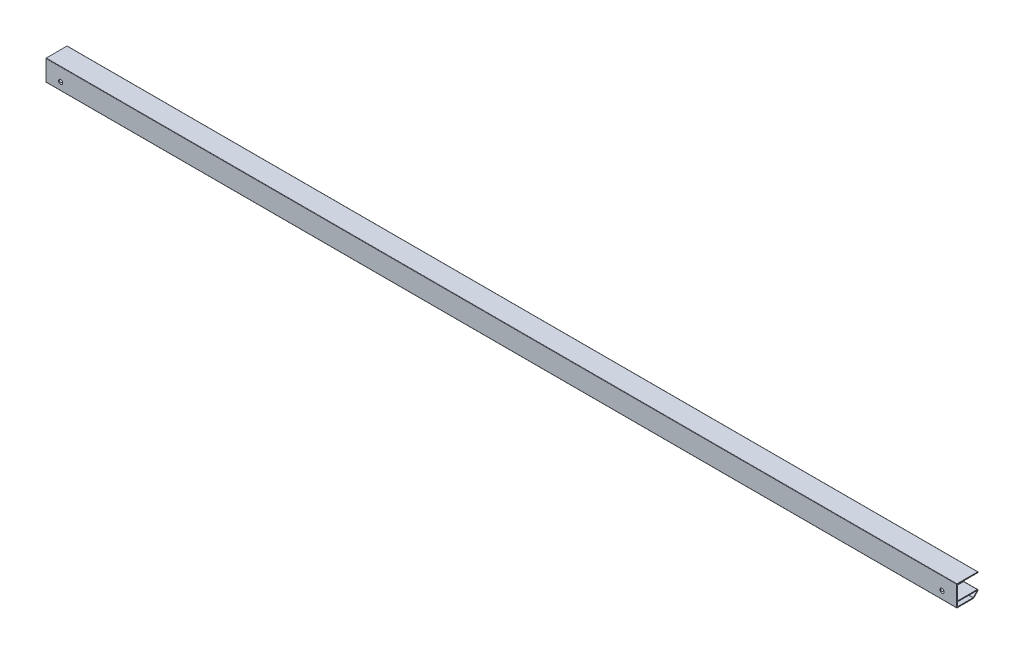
ISO-10303-21;
HEADER;
FILE_DESCRIPTION(('STEP AP214'),'2;1');
FILE_NAME('part.step','',(''),(''),'','','');
FILE_SCHEMA(('AUTOMOTIVE_DESIGN { 1 0 10303 214 1 1 1 1 }'));
ENDSEC;
DATA;
#1=APPLICATION_CONTEXT('core data for automotive mechanical design processes');
#2=APPLICATION_PROTOCOL_DEFINITION('international standard','automotive_design',2000,#1);
#3=PRODUCT_CONTEXT('',#1,'mechanical');
#4=PRODUCT('Part','Part','',(#3));
#5=PRODUCT_RELATED_PRODUCT_CATEGORY('part','',(#4));
#6=PRODUCT_DEFINITION_FORMATION('','',#4);
#7=PRODUCT_DEFINITION_CONTEXT('part definition',#1,'design');
#8=PRODUCT_DEFINITION('design','',#6,#7);
#9=PRODUCT_DEFINITION_SHAPE('','',#8);
#10=(LENGTH_UNIT() NAMED_UNIT(*) SI_UNIT(.MILLI.,.METRE.));
#11=(NAMED_UNIT(*) PLANE_ANGLE_UNIT() SI_UNIT($,.RADIAN.));
#12=(NAMED_UNIT(*) SI_UNIT($,.STERADIAN.) SOLID_ANGLE_UNIT());
#13=UNCERTAINTY_MEASURE_WITH_UNIT(LENGTH_MEASURE(1.E-05),#10,'distance_accuracy_value','');
#14=(GEOMETRIC_REPRESENTATION_CONTEXT(3) GLOBAL_UNCERTAINTY_ASSIGNED_CONTEXT((#13)) GLOBAL_UNIT_ASSIGNED_CONTEXT((#10,
#11,#12)) REPRESENTATION_CONTEXT('',''));
#15=CARTESIAN_POINT('',(0.,0.,0.));
#16=DIRECTION('',(0.,0.,1.));
#17=DIRECTION('',(1.,0.,0.));
#18=AXIS2_PLACEMENT_3D('',#15,#16,#17);
#19=CARTESIAN_POINT('',(1087.,7.,-1.25));
#20=DIRECTION('',(0.,-1.,0.));
#21=DIRECTION('',(0.,0.,-1.));
#22=AXIS2_PLACEMENT_3D('',#19,#20,#21);
#23=PLANE('',#22);
#24=DIRECTION('',(-1.,0.,0.));
#25=VECTOR('',#24,1.);
#26=CARTESIAN_POINT('',(1087.,7.,-24.4));
#27=LINE('',#26,#25);
#28=CARTESIAN_POINT('',(1087.,7.,-24.4));
#29=VERTEX_POINT('',#28);
#30=CARTESIAN_POINT('',(1070.6874342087,7.,-24.4));
#31=VERTEX_POINT('',#30);
#32=EDGE_CURVE('E522',#29,#31,#27,.T.);
#33=ORIENTED_EDGE('',*,*,#32,.T.);
#34=DIRECTION('',(0.,0.,1.));
#35=VECTOR('',#34,1.);
#36=CARTESIAN_POINT('',(1070.6874342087,7.,-25.4));
#37=LINE('',#36,#35);
#38=CARTESIAN_POINT('',(1070.6874342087,7.,-1.25));
#39=VERTEX_POINT('',#38);
#40=EDGE_CURVE('E493',#31,#39,#37,.T.);
#41=ORIENTED_EDGE('',*,*,#40,.T.);
#42=DIRECTION('',(-1.,0.,0.));
#43=VECTOR('',#42,1.);
#44=CARTESIAN_POINT('',(1087.,7.,-1.25));
#45=LINE('',#44,#43);
#46=CARTESIAN_POINT('',(1087.,7.,-1.25));
#47=VERTEX_POINT('',#46);
#48=EDGE_CURVE('E257',#47,#39,#45,.T.);
#49=ORIENTED_EDGE('',*,*,#48,.F.);
#50=DIRECTION('',(0.,0.,1.));
#51=VECTOR('',#50,1.);
#52=CARTESIAN_POINT('',(1087.,7.,-1.25));
#53=LINE('',#52,#51);
#54=EDGE_CURVE('E362',#29,#47,#53,.T.);
#55=ORIENTED_EDGE('',*,*,#54,.F.);
#56=EDGE_LOOP('',(#33,#41,#49,#55));
#57=FACE_BOUND('',#56,.T.);
#58=ADVANCED_FACE('F32',(#57),#23,.F.);
#59=CARTESIAN_POINT('',(1087.,7.25,-1.25));
#60=DIRECTION('',(-1.,0.,0.));
#61=DIRECTION('',(0.,0.,1.));
#62=AXIS2_PLACEMENT_3D('',#59,#60,#61);
#63=CYLINDRICAL_SURFACE('',#62,0.25);
#64=ORIENTED_EDGE('',*,*,#48,.T.);
#65=CARTESIAN_POINT('',(1071.06444878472,7.25,-1.));
#66=CARTESIAN_POINT('',(1071.08875339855,7.26949851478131,-1.000000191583));
#67=CARTESIAN_POINT('',(1071.11269518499,7.28945793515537,-1.0022622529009));
#68=CARTESIAN_POINT('',(1071.15916330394,7.32967680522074,-1.01213819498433));
#69=CARTESIAN_POINT('',(1071.18169475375,7.34993479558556,-1.01973133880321));
#70=CARTESIAN_POINT('',(1071.21488447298,7.38081353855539,-1.03658464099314));
#71=CARTESIAN_POINT('',(1071.2263913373,7.39173882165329,-1.0436271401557));
#72=CARTESIAN_POINT('',(1071.24835953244,7.41297170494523,-1.05994948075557));
#73=CARTESIAN_POINT('',(1071.25882193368,7.42327993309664,-1.06922699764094));
#74=CARTESIAN_POINT('',(1071.27643312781,7.44090641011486,-1.0881714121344));
#75=CARTESIAN_POINT('',(1071.28383256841,7.44841889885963,-1.09742222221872));
#76=CARTESIAN_POINT('',(1071.29741208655,7.46235672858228,-1.11751044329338));
#77=CARTESIAN_POINT('',(1071.3035937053,7.46878344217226,-1.12834581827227));
#78=CARTESIAN_POINT('',(1071.31340705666,7.4790712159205,-1.14932116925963));
#79=CARTESIAN_POINT('',(1071.31729937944,7.48318726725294,-1.15921331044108));
#80=CARTESIAN_POINT('',(1071.32388807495,7.49018845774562,-1.17980400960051));
#81=CARTESIAN_POINT('',(1071.3265850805,7.49307424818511,-1.19050213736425));
#82=CARTESIAN_POINT('',(1071.33064210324,7.4974258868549,-1.21249466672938));
#83=CARTESIAN_POINT('',(1071.33199501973,7.49888419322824,-1.22379190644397));
#84=CARTESIAN_POINT('',(1071.33324937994,7.50023599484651,-1.24655951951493));
#85=CARTESIAN_POINT('',(1071.33315124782,7.5001299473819,-1.25802984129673));
#86=CARTESIAN_POINT('',(1071.3315850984,7.49844276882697,-1.27973546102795));
#87=CARTESIAN_POINT('',(1071.33023880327,7.49699271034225,-1.28999038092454));
#88=CARTESIAN_POINT('',(1071.32642140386,7.49289935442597,-1.31003843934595));
#89=CARTESIAN_POINT('',(1071.32395025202,7.49025600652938,-1.31983155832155));
#90=CARTESIAN_POINT('',(1071.31789913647,7.48382323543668,-1.33906775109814));
#91=CARTESIAN_POINT('',(1071.31428446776,7.4799980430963,-1.34848775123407));
#92=CARTESIAN_POINT('',(1071.30612967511,7.47143683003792,-1.36646935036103));
#93=CARTESIAN_POINT('',(1071.30158906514,7.46670033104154,-1.37503049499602));
#94=CARTESIAN_POINT('',(1071.2894564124,7.45416148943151,-1.39495963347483));
#95=CARTESIAN_POINT('',(1071.2814222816,7.44595199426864,-1.40580374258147));
#96=CARTESIAN_POINT('',(1071.26409935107,7.42853012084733,-1.42550147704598));
#97=CARTESIAN_POINT('',(1071.25480789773,7.41931562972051,-1.43435078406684));
#98=CARTESIAN_POINT('',(1071.23139406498,7.39649352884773,-1.45332042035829));
#99=CARTESIAN_POINT('',(1071.21682304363,7.38259966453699,-1.46253976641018));
#100=CARTESIAN_POINT('',(1071.18646745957,7.35439422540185,-1.47772594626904));
#101=CARTESIAN_POINT('',(1071.170681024,7.34008202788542,-1.48368764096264));
#102=CARTESIAN_POINT('',(1071.13119178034,7.30522454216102,-1.49477820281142));
#103=CARTESIAN_POINT('',(1071.10705164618,7.28469648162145,-1.49839702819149));
#104=CARTESIAN_POINT('',(1071.05785597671,7.2444690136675,-1.50075162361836));
#105=CARTESIAN_POINT('',(1071.0327987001,7.22477135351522,-1.49947757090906));
#106=CARTESIAN_POINT('',(1070.98149833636,7.18599131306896,-1.49249510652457));
#107=CARTESIAN_POINT('',(1070.95524360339,7.16695148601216,-1.48663994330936));
#108=CARTESIAN_POINT('',(1070.90298262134,7.13054405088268,-1.47051641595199));
#109=CARTESIAN_POINT('',(1070.87697595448,7.11317287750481,-1.46025772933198));
#110=CARTESIAN_POINT('',(1070.83749249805,7.08779857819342,-1.4405783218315));
#111=CARTESIAN_POINT('',(1070.82362286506,7.07908554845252,-1.43284184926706));
#112=CARTESIAN_POINT('',(1070.79647695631,7.06238454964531,-1.41566397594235));
#113=CARTESIAN_POINT('',(1070.78320086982,7.05439681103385,-1.40622203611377));
#114=CARTESIAN_POINT('',(1070.76034865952,7.04091219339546,-1.38743105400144));
#115=CARTESIAN_POINT('',(1070.75057057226,7.03523974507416,-1.37845672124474));
#116=CARTESIAN_POINT('',(1070.73217901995,7.02471941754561,-1.35895444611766));
#117=CARTESIAN_POINT('',(1070.72356222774,7.01986917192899,-1.34843113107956));
#118=CARTESIAN_POINT('',(1070.71155955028,7.01318742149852,-1.33042889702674));
#119=CARTESIAN_POINT('',(1070.70750501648,7.01094801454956,-1.32355145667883));
#120=CARTESIAN_POINT('',(1070.70030930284,7.00699422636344,-1.30919008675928));
#121=CARTESIAN_POINT('',(1070.69716684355,7.00527910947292,-1.3017070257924));
#122=CARTESIAN_POINT('',(1070.69246345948,7.00272053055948,-1.28738314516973));
#123=CARTESIAN_POINT('',(1070.69073594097,7.00178487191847,-1.28061453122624));
#124=CARTESIAN_POINT('',(1070.68830985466,7.00047239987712,-1.26684257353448));
#125=CARTESIAN_POINT('',(1070.68761033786,7.00009507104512,-1.25983945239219));
#126=CARTESIAN_POINT('',(1070.68731672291,6.99993658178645,-1.24578655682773));
#127=CARTESIAN_POINT('',(1070.68772512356,7.00015676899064,-1.23873671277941));
#128=CARTESIAN_POINT('',(1070.68960517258,7.00117290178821,-1.22482288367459));
#129=CARTESIAN_POINT('',(1070.69107770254,7.00196932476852,-1.21795905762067));
#130=CARTESIAN_POINT('',(1070.6954218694,7.00432835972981,-1.20291528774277));
#131=CARTESIAN_POINT('',(1070.69855047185,7.0060323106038,-1.19483283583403));
#132=CARTESIAN_POINT('',(1070.70589035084,7.01005798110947,-1.17934429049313));
#133=CARTESIAN_POINT('',(1070.71010391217,7.01238100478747,-1.17193966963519));
#134=CARTESIAN_POINT('',(1070.72207747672,7.01903764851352,-1.15355442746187));
#135=CARTESIAN_POINT('',(1070.7304445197,7.02373930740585,-1.14310768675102));
#136=CARTESIAN_POINT('',(1070.74834063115,7.03395437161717,-1.12372902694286));
#137=CARTESIAN_POINT('',(1070.75787283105,7.03946997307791,-1.11480135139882));
#138=CARTESIAN_POINT('',(1070.78608809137,7.05607250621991,-1.09110487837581));
#139=CARTESIAN_POINT('',(1070.80562445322,7.06788958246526,-1.07787144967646));
#140=CARTESIAN_POINT('',(1070.84570317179,7.0929522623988,-1.0547435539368));
#141=CARTESIAN_POINT('',(1070.86624792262,7.1062013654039,-1.04485752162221));
#142=CARTESIAN_POINT('',(1070.91640729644,7.13965192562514,-1.0244965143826));
#143=CARTESIAN_POINT('',(1070.94623144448,7.16044858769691,-1.01549512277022));
#144=CARTESIAN_POINT('',(1071.00569361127,7.2039426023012,-1.00324584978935));
#145=CARTESIAN_POINT('',(1071.03533156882,7.22664054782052,-0.999999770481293));
#146=CARTESIAN_POINT('',(1071.06444878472,7.25,-1.));
#147=B_SPLINE_CURVE_WITH_KNOTS('',3,(#65,#66,#67,#68,#69,#70,#71,#72,#73,#74,#75,#76,#77,#78,
#79,#80,#81,#82,#83,#84,#85,#86,#87,#88,#89,#90,#91,#92,#93,#94,#95,#96,#97,#98,#99,#100,#101,
#102,#103,#104,#105,#106,#107,#108,#109,#110,#111,#112,#113,#114,#115,#116,#117,#118,#119,#120,
#121,#122,#123,#124,#125,#126,#127,#128,#129,#130,#131,#132,#133,#134,#135,#136,#137,#138,#139,
#140,#141,#142,#143,#144,#145,#146),.UNSPECIFIED.,.T.,.F.,(4,2,2,2,2,2,2,2,2,2,2,2,2,2,2,2,2,2,
2,2,2,2,2,2,2,2,2,2,2,2,2,2,2,2,2,2,2,2,2,2,4),(0.,0.0933851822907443,0.186409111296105,
0.238345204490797,0.290227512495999,0.332157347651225,0.374033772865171,0.408092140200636,
0.442132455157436,0.476351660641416,0.510560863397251,0.541749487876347,0.572939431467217,
0.605185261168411,0.637448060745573,0.684573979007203,0.731800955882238,0.797865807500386,
0.864034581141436,0.959202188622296,1.05456095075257,1.1531061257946,1.25143583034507,
1.30570561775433,1.3599925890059,1.40319455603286,1.44626998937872,1.47107804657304,
1.49585113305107,1.51690558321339,1.53794058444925,1.55902306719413,1.58012303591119,
1.60647329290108,1.63287950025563,1.67519790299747,1.71763264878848,1.79636338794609,
1.87529106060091,1.98713260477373,2.0990091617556),.UNSPECIFIED.);
#148=CARTESIAN_POINT('',(1071.06444878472,7.25,-1.));
#149=VERTEX_POINT('',#148);
#150=EDGE_CURVE('E242',#39,#149,#147,.T.);
#151=ORIENTED_EDGE('',*,*,#150,.T.);
#152=DIRECTION('',(-1.,0.,0.));
#153=VECTOR('',#152,1.);
#154=CARTESIAN_POINT('',(1087.,7.25,-1.));
#155=LINE('',#154,#153);
#156=CARTESIAN_POINT('',(1087.,7.25,-1.));
#157=VERTEX_POINT('',#156);
#158=EDGE_CURVE('E254',#157,#149,#155,.T.);
#159=ORIENTED_EDGE('',*,*,#158,.F.);
#160=CARTESIAN_POINT('',(1087.,7.25,-1.25));
#161=DIRECTION('',(-1.,0.,0.));
#162=DIRECTION('',(0.,0.,-1.));
#163=AXIS2_PLACEMENT_3D('',#160,#161,#162);
#164=CIRCLE('',#163,0.25);
#165=EDGE_CURVE('E360',#47,#157,#164,.T.);
#166=ORIENTED_EDGE('',*,*,#165,.F.);
#167=EDGE_LOOP('',(#64,#151,#159,#166));
#168=FACE_BOUND('',#167,.T.);
#169=ADVANCED_FACE('F252',(#168),#63,.F.);
#170=CARTESIAN_POINT('',(1068.3125657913,6.99999999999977,-1.25000000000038));
#171=VERTEX_POINT('',#170);
#172=CARTESIAN_POINT('',(18.6874342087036,7.,-1.25));
#173=VERTEX_POINT('',#172);
#174=EDGE_CURVE('E267',#171,#173,#45,.T.);
#175=ORIENTED_EDGE('',*,*,#174,.F.);
#176=DIRECTION('',(0.,0.,1.));
#177=VECTOR('',#176,1.);
#178=CARTESIAN_POINT('',(1068.3125657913,7.,-25.4));
#179=LINE('',#178,#177);
#180=CARTESIAN_POINT('',(1068.3125657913,7.,-24.4));
#181=VERTEX_POINT('',#180);
#182=EDGE_CURVE('E258',#171,#181,#179,.F.);
#183=ORIENTED_EDGE('',*,*,#182,.T.);
#184=CARTESIAN_POINT('',(18.6874342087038,7.,-24.4));
#185=VERTEX_POINT('',#184);
#186=EDGE_CURVE('E511',#181,#185,#27,.T.);
#187=ORIENTED_EDGE('',*,*,#186,.T.);
#188=DIRECTION('',(0.,0.,1.));
#189=VECTOR('',#188,1.);
#190=CARTESIAN_POINT('',(18.6874342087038,7.,-25.4));
#191=LINE('',#190,#189);
#192=EDGE_CURVE('E444',#185,#173,#191,.T.);
#193=ORIENTED_EDGE('',*,*,#192,.T.);
#194=EDGE_LOOP('',(#175,#183,#187,#193));
#195=FACE_BOUND('',#194,.T.);
#196=ADVANCED_FACE('F509',(#195),#23,.F.);
#197=CARTESIAN_POINT('',(15.9355512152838,7.25,-1.));
#198=VERTEX_POINT('',#197);
#199=CARTESIAN_POINT('',(0.,7.25,-1.));
#200=VERTEX_POINT('',#199);
#201=EDGE_CURVE('E266',#198,#200,#155,.T.);
#202=ORIENTED_EDGE('',*,*,#201,.F.);
#203=CARTESIAN_POINT('',(15.9355512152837,7.25,-1.));
#204=CARTESIAN_POINT('',(15.9499217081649,7.23846856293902,-1.00000806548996));
#205=CARTESIAN_POINT('',(15.96441638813,7.22710307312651,-1.00079769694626));
#206=CARTESIAN_POINT('',(15.9935597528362,7.20476249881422,-1.00386635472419));
#207=CARTESIAN_POINT('',(16.0082085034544,7.19378759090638,-1.00614604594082));
#208=CARTESIAN_POINT('',(16.03770112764,7.17218834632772,-1.01215118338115));
#209=CARTESIAN_POINT('',(16.05254547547,7.16156868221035,-1.01589102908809));
#210=CARTESIAN_POINT('',(16.0821647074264,7.14085712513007,-1.02480031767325));
#211=CARTESIAN_POINT('',(16.0969396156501,7.13076503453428,-1.02996922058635));
#212=CARTESIAN_POINT('',(16.1305591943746,7.10831399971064,-1.04349642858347));
#213=CARTESIAN_POINT('',(16.1493386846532,7.09614867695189,-1.05234507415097));
#214=CARTESIAN_POINT('',(16.1860872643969,7.07300682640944,-1.0727657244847));
#215=CARTESIAN_POINT('',(16.2040588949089,7.06202639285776,-1.08432835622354));
#216=CARTESIAN_POINT('',(16.230661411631,7.04618879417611,-1.10492787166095));
#217=CARTESIAN_POINT('',(16.2398788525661,7.0407873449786,-1.11278592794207));
#218=CARTESIAN_POINT('',(16.2574988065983,7.03060070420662,-1.12974214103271));
#219=CARTESIAN_POINT('',(16.2659019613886,7.02581502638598,-1.13883930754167));
#220=CARTESIAN_POINT('',(16.2792793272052,7.01828431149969,-1.15582404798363));
#221=CARTESIAN_POINT('',(16.2845660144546,7.01533754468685,-1.16337253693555));
#222=CARTESIAN_POINT('',(16.2941038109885,7.01005845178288,-1.17930282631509));
#223=CARTESIAN_POINT('',(16.2983566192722,7.00772511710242,-1.18768322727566));
#224=CARTESIAN_POINT('',(16.304529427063,7.00435446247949,-1.20305313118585));
#225=CARTESIAN_POINT('',(16.3067661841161,7.00313937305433,-1.20987474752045));
#226=CARTESIAN_POINT('',(16.3102068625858,7.00127391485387,-1.22383940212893));
#227=CARTESIAN_POINT('',(16.3114137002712,7.00062195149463,-1.23098147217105));
#228=CARTESIAN_POINT('',(16.3123942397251,7.00009265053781,-1.24211034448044));
#229=CARTESIAN_POINT('',(16.3125700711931,6.9999978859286,-1.24605521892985));
#230=CARTESIAN_POINT('',(16.3125657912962,7.,-1.24999999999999));
#231=B_SPLINE_CURVE_WITH_KNOTS('',3,(#203,#204,#205,#206,#207,#208,#209,#210,#211,#212,#213,
#214,#215,#216,#217,#218,#219,#220,#221,#222,#223,#224,#225,#226,#227,#228,#229,#230),
.UNSPECIFIED.,.F.,.F.,(4,2,2,2,2,2,2,2,2,2,2,2,2,4),(0.,0.0552478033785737,0.110520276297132,
0.166352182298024,0.222163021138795,0.294194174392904,0.365980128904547,0.405700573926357,
0.445389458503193,0.474335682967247,0.503234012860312,0.524992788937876,0.546689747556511,
0.558521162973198),.UNSPECIFIED.);
#232=CARTESIAN_POINT('',(16.3125657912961,7.,-1.25));
#233=VERTEX_POINT('',#232);
#234=EDGE_CURVE('E55',#198,#233,#231,.T.);
#235=ORIENTED_EDGE('',*,*,#234,.T.);
#236=CARTESIAN_POINT('',(0.,7.,-1.25));
#237=VERTEX_POINT('',#236);
#238=EDGE_CURVE('E263',#233,#237,#45,.T.);
#239=ORIENTED_EDGE('',*,*,#238,.T.);
#240=CARTESIAN_POINT('',(0.,7.25,-1.25));
#241=DIRECTION('',(-1.,0.,0.));
#242=DIRECTION('',(0.,0.,-1.));
#243=AXIS2_PLACEMENT_3D('',#240,#241,#242);
#244=CIRCLE('',#243,0.25);
#245=EDGE_CURVE('E322',#237,#200,#244,.T.);
#246=ORIENTED_EDGE('',*,*,#245,.T.);
#247=EDGE_LOOP('',(#202,#235,#239,#246));
#248=FACE_BOUND('',#247,.T.);
#249=ADVANCED_FACE('F479',(#248),#63,.F.);
#250=CARTESIAN_POINT('',(1087.,0.4,-0.4));
#251=DIRECTION('',(1.,0.,0.));
#252=DIRECTION('',(0.,0.,-1.));
#253=AXIS2_PLACEMENT_3D('',#250,#251,#252);
#254=PLANE('',#253);
#255=CARTESIAN_POINT('',(1087.,0.4,-0.4));
#256=DIRECTION('',(1.,0.,0.));
#257=DIRECTION('',(0.,0.,-1.));
#258=AXIS2_PLACEMENT_3D('',#255,#256,#257);
#259=CIRCLE('',#258,0.4);
#260=CARTESIAN_POINT('',(1087.,0.400000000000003,0.));
#261=VERTEX_POINT('',#260);
#262=CARTESIAN_POINT('',(1087.,0.,-0.400000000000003));
#263=VERTEX_POINT('',#262);
#264=EDGE_CURVE('E305',#261,#263,#259,.T.);
#265=ORIENTED_EDGE('',*,*,#264,.T.);
#266=DIRECTION('',(0.,0.,-1.));
#267=VECTOR('',#266,1.);
#268=CARTESIAN_POINT('',(1087.,0.,-0.400000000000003));
#269=LINE('',#268,#267);
#270=CARTESIAN_POINT('',(1087.,0.,-19.5857864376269));
#271=VERTEX_POINT('',#270);
#272=EDGE_CURVE('E374',#263,#271,#269,.T.);
#273=ORIENTED_EDGE('',*,*,#272,.T.);
#274=CARTESIAN_POINT('',(1087.,1.,-19.5857864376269));
#275=DIRECTION('',(1.,0.,0.));
#276=DIRECTION('',(0.,0.,-1.));
#277=AXIS2_PLACEMENT_3D('',#274,#275,#276);
#278=CIRCLE('',#277,0.999999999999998);
#279=CARTESIAN_POINT('',(1087.,0.292893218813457,-20.2928932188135));
#280=VERTEX_POINT('',#279);
#281=EDGE_CURVE('E372',#271,#280,#278,.T.);
#282=ORIENTED_EDGE('',*,*,#281,.T.);
#283=DIRECTION('',(0.,0.707106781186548,-0.707106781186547));
#284=VECTOR('',#283,1.);
#285=CARTESIAN_POINT('',(1087.,0.292893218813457,-20.2928932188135));
#286=LINE('',#285,#284);
#287=CARTESIAN_POINT('',(1087.,5.10710678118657,-25.1071067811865));
#288=VERTEX_POINT('',#287);
#289=EDGE_CURVE('E370',#280,#288,#286,.T.);
#290=ORIENTED_EDGE('',*,*,#289,.T.);
#291=CARTESIAN_POINT('',(1087.,5.81421356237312,-24.4));
#292=DIRECTION('',(1.,0.,0.));
#293=DIRECTION('',(0.,0.,-1.));
#294=AXIS2_PLACEMENT_3D('',#291,#292,#293);
#295=CIRCLE('',#294,1.);
#296=CARTESIAN_POINT('',(1087.,5.81421356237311,-25.4));
#297=VERTEX_POINT('',#296);
#298=EDGE_CURVE('E368',#288,#297,#295,.T.);
#299=ORIENTED_EDGE('',*,*,#298,.T.);
#300=DIRECTION('',(0.,1.,0.));
#301=VECTOR('',#300,1.);
#302=CARTESIAN_POINT('',(1087.,6.,-25.4));
#303=LINE('',#302,#301);
#304=CARTESIAN_POINT('',(1087.,6.,-25.4));
#305=VERTEX_POINT('',#304);
#306=EDGE_CURVE('E366',#297,#305,#303,.T.);
#307=ORIENTED_EDGE('',*,*,#306,.T.);
#308=CARTESIAN_POINT('',(1087.,6.,-24.4));
#309=DIRECTION('',(1.,0.,0.));
#310=DIRECTION('',(0.,0.,1.));
#311=AXIS2_PLACEMENT_3D('',#308,#309,#310);
#312=CIRCLE('',#311,1.);
#313=EDGE_CURVE('E364',#305,#29,#312,.T.);
#314=ORIENTED_EDGE('',*,*,#313,.T.);
#315=ORIENTED_EDGE('',*,*,#54,.T.);
#316=ORIENTED_EDGE('',*,*,#165,.T.);
#317=DIRECTION('',(0.,1.,0.));
#318=VECTOR('',#317,1.);
#319=CARTESIAN_POINT('',(1087.,23.75,-0.999999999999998));
#320=LINE('',#319,#318);
#321=CARTESIAN_POINT('',(1087.,23.75,-0.999999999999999));
#322=VERTEX_POINT('',#321);
#323=EDGE_CURVE('E262',#157,#322,#320,.T.);
#324=ORIENTED_EDGE('',*,*,#323,.T.);
#325=CARTESIAN_POINT('',(1087.,23.75,-1.25));
#326=DIRECTION('',(-1.,0.,0.));
#327=DIRECTION('',(0.,0.,-1.));
#328=AXIS2_PLACEMENT_3D('',#325,#326,#327);
#329=CIRCLE('',#328,0.249999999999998);
#330=CARTESIAN_POINT('',(1087.,24.,-1.25));
#331=VERTEX_POINT('',#330);
#332=EDGE_CURVE('E357',#322,#331,#329,.T.);
#333=ORIENTED_EDGE('',*,*,#332,.T.);
#334=DIRECTION('',(0.,0.,-1.));
#335=VECTOR('',#334,1.);
#336=CARTESIAN_POINT('',(1087.,24.,-25.));
#337=LINE('',#336,#335);
#338=CARTESIAN_POINT('',(1087.,24.,-25.));
#339=VERTEX_POINT('',#338);
#340=EDGE_CURVE('E355',#331,#339,#337,.T.);
#341=ORIENTED_EDGE('',*,*,#340,.T.);
#342=CARTESIAN_POINT('',(1087.,24.4,-25.));
#343=DIRECTION('',(1.,0.,0.));
#344=DIRECTION('',(0.,0.,1.));
#345=AXIS2_PLACEMENT_3D('',#342,#343,#344);
#346=CIRCLE('',#345,0.400000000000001);
#347=CARTESIAN_POINT('',(1087.,24.4,-25.4));
#348=VERTEX_POINT('',#347);
#349=EDGE_CURVE('E353',#339,#348,#346,.T.);
#350=ORIENTED_EDGE('',*,*,#349,.T.);
#351=DIRECTION('',(0.,1.,0.));
#352=VECTOR('',#351,1.);
#353=CARTESIAN_POINT('',(1087.,24.6,-25.4));
#354=LINE('',#353,#352);
#355=CARTESIAN_POINT('',(1087.,24.6,-25.4));
#356=VERTEX_POINT('',#355);
#357=EDGE_CURVE('E351',#348,#356,#354,.T.);
#358=ORIENTED_EDGE('',*,*,#357,.T.);
#359=CARTESIAN_POINT('',(1087.,24.6,-25.));
#360=DIRECTION('',(1.,0.,0.));
#361=DIRECTION('',(0.,0.,1.));
#362=AXIS2_PLACEMENT_3D('',#359,#360,#361);
#363=CIRCLE('',#362,0.400000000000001);
#364=CARTESIAN_POINT('',(1087.,25.,-25.));
#365=VERTEX_POINT('',#364);
#366=EDGE_CURVE('E349',#356,#365,#363,.T.);
#367=ORIENTED_EDGE('',*,*,#366,.T.);
#368=DIRECTION('',(0.,0.,1.));
#369=VECTOR('',#368,1.);
#370=CARTESIAN_POINT('',(1087.,25.,-0.4));
#371=LINE('',#370,#369);
#372=CARTESIAN_POINT('',(1087.,25.,-0.4));
#373=VERTEX_POINT('',#372);
#374=EDGE_CURVE('E347',#365,#373,#371,.T.);
#375=ORIENTED_EDGE('',*,*,#374,.T.);
#376=CARTESIAN_POINT('',(1087.,24.6,-0.4));
#377=DIRECTION('',(1.,0.,0.));
#378=DIRECTION('',(0.,0.,1.));
#379=AXIS2_PLACEMENT_3D('',#376,#377,#378);
#380=CIRCLE('',#379,0.400000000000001);
#381=CARTESIAN_POINT('',(1087.,24.6,0.));
#382=VERTEX_POINT('',#381);
#383=EDGE_CURVE('E345',#373,#382,#380,.T.);
#384=ORIENTED_EDGE('',*,*,#383,.T.);
#385=DIRECTION('',(0.,-1.,0.));
#386=VECTOR('',#385,1.);
#387=CARTESIAN_POINT('',(1087.,24.6,0.));
#388=LINE('',#387,#386);
#389=EDGE_CURVE('E302',#382,#261,#388,.T.);
#390=ORIENTED_EDGE('',*,*,#389,.T.);
#391=EDGE_LOOP('',(#265,#273,#282,#290,#299,#307,#314,#315,#316,#324,#333,#341,#350,#358,#367,
#375,#384,#390));
#392=FACE_BOUND('',#391,.T.);
#393=DIRECTION('',(0.,0.,1.));
#394=VECTOR('',#393,1.);
#395=CARTESIAN_POINT('',(1087.,6.,-1.25));
#396=LINE('',#395,#394);
#397=CARTESIAN_POINT('',(1087.,6.,-23.8584989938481));
#398=VERTEX_POINT('',#397);
#399=CARTESIAN_POINT('',(1087.,6.,-1.25));
#400=VERTEX_POINT('',#399);
#401=EDGE_CURVE('E434',#398,#400,#396,.T.);
#402=ORIENTED_EDGE('',*,*,#401,.F.);
#403=CARTESIAN_POINT('',(1087.,5.69874767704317,-23.8584989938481));
#404=DIRECTION('',(1.,0.,0.));
#405=DIRECTION('',(0.,0.,-1.));
#406=AXIS2_PLACEMENT_3D('',#403,#404,#405);
#407=CIRCLE('',#406,0.301252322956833);
#408=CARTESIAN_POINT('',(1087.,5.48573011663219,-24.0715165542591));
#409=VERTEX_POINT('',#408);
#410=EDGE_CURVE('E399',#409,#398,#407,.T.);
#411=ORIENTED_EDGE('',*,*,#410,.F.);
#412=DIRECTION('',(0.,0.707106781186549,-0.707106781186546));
#413=VECTOR('',#412,1.);
#414=CARTESIAN_POINT('',(1087.,1.11715728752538,-19.7029437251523));
#415=LINE('',#414,#413);
#416=CARTESIAN_POINT('',(1087.,1.11715728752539,-19.7029437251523));
#417=VERTEX_POINT('',#416);
#418=EDGE_CURVE('E395',#417,#409,#415,.T.);
#419=ORIENTED_EDGE('',*,*,#418,.F.);
#420=CARTESIAN_POINT('',(1087.,1.4,-19.4201010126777));
#421=DIRECTION('',(1.,0.,0.));
#422=DIRECTION('',(0.,0.,-1.));
#423=AXIS2_PLACEMENT_3D('',#420,#421,#422);
#424=CIRCLE('',#423,0.399999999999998);
#425=CARTESIAN_POINT('',(1087.,1.,-19.4201010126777));
#426=VERTEX_POINT('',#425);
#427=EDGE_CURVE('E423',#426,#417,#424,.T.);
#428=ORIENTED_EDGE('',*,*,#427,.F.);
#429=DIRECTION('',(0.,0.,-1.));
#430=VECTOR('',#429,1.);
#431=CARTESIAN_POINT('',(1087.,1.,-1.25000000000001));
#432=LINE('',#431,#430);
#433=CARTESIAN_POINT('',(1087.,1.,-1.25000000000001));
#434=VERTEX_POINT('',#433);
#435=EDGE_CURVE('E426',#434,#426,#432,.T.);
#436=ORIENTED_EDGE('',*,*,#435,.F.);
#437=CARTESIAN_POINT('',(1087.,1.25,-1.25));
#438=DIRECTION('',(1.,0.,0.));
#439=DIRECTION('',(0.,0.,-1.));
#440=AXIS2_PLACEMENT_3D('',#437,#438,#439);
#441=CIRCLE('',#440,0.25);
#442=CARTESIAN_POINT('',(1087.,1.25,-1.));
#443=VERTEX_POINT('',#442);
#444=EDGE_CURVE('E428',#443,#434,#441,.T.);
#445=ORIENTED_EDGE('',*,*,#444,.F.);
#446=DIRECTION('',(0.,-1.,0.));
#447=VECTOR('',#446,1.);
#448=CARTESIAN_POINT('',(1087.,5.75,-1.));
#449=LINE('',#448,#447);
#450=CARTESIAN_POINT('',(1087.,5.75,-1.));
#451=VERTEX_POINT('',#450);
#452=EDGE_CURVE('E430',#451,#443,#449,.T.);
#453=ORIENTED_EDGE('',*,*,#452,.F.);
#454=CARTESIAN_POINT('',(1087.,5.75,-1.25));
#455=DIRECTION('',(1.,0.,0.));
#456=DIRECTION('',(0.,0.,1.));
#457=AXIS2_PLACEMENT_3D('',#454,#455,#456);
#458=CIRCLE('',#457,0.25);
#459=EDGE_CURVE('E432',#400,#451,#458,.T.);
#460=ORIENTED_EDGE('',*,*,#459,.F.);
#461=EDGE_LOOP('',(#402,#411,#419,#428,#436,#445,#453,#460));
#462=FACE_BOUND('',#461,.T.);
#463=ADVANCED_FACE('F565',(#392,#462),#254,.T.);
#464=CARTESIAN_POINT('',(0.,0.4,-0.4));
#465=DIRECTION('',(1.,0.,0.));
#466=DIRECTION('',(0.,0.,-1.));
#467=AXIS2_PLACEMENT_3D('',#464,#465,#466);
#468=PLANE('',#467);
#469=CARTESIAN_POINT('',(0.,0.4,-0.4));
#470=DIRECTION('',(1.,0.,0.));
#471=DIRECTION('',(0.,0.,-1.));
#472=AXIS2_PLACEMENT_3D('',#469,#470,#471);
#473=CIRCLE('',#472,0.4);
#474=CARTESIAN_POINT('',(0.,0.400000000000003,0.));
#475=VERTEX_POINT('',#474);
#476=CARTESIAN_POINT('',(0.,0.,-0.400000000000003));
#477=VERTEX_POINT('',#476);
#478=EDGE_CURVE('E340',#475,#477,#473,.T.);
#479=ORIENTED_EDGE('',*,*,#478,.F.);
#480=DIRECTION('',(0.,-1.,0.));
#481=VECTOR('',#480,1.);
#482=CARTESIAN_POINT('',(0.,24.6,0.));
#483=LINE('',#482,#481);
#484=CARTESIAN_POINT('',(0.,24.6,0.));
#485=VERTEX_POINT('',#484);
#486=EDGE_CURVE('E303',#485,#475,#483,.T.);
#487=ORIENTED_EDGE('',*,*,#486,.F.);
#488=CARTESIAN_POINT('',(0.,24.6,-0.4));
#489=DIRECTION('',(1.,0.,0.));
#490=DIRECTION('',(0.,0.,1.));
#491=AXIS2_PLACEMENT_3D('',#488,#489,#490);
#492=CIRCLE('',#491,0.400000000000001);
#493=CARTESIAN_POINT('',(0.,25.,-0.4));
#494=VERTEX_POINT('',#493);
#495=EDGE_CURVE('E306',#494,#485,#492,.T.);
#496=ORIENTED_EDGE('',*,*,#495,.F.);
#497=DIRECTION('',(0.,0.,1.));
#498=VECTOR('',#497,1.);
#499=CARTESIAN_POINT('',(0.,25.,-0.4));
#500=LINE('',#499,#498);
#501=CARTESIAN_POINT('',(0.,25.,-25.));
#502=VERTEX_POINT('',#501);
#503=EDGE_CURVE('E308',#502,#494,#500,.T.);
#504=ORIENTED_EDGE('',*,*,#503,.F.);
#505=CARTESIAN_POINT('',(0.,24.6,-25.));
#506=DIRECTION('',(1.,0.,0.));
#507=DIRECTION('',(0.,0.,1.));
#508=AXIS2_PLACEMENT_3D('',#505,#506,#507);
#509=CIRCLE('',#508,0.400000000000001);
#510=CARTESIAN_POINT('',(0.,24.6,-25.4));
#511=VERTEX_POINT('',#510);
#512=EDGE_CURVE('E310',#511,#502,#509,.T.);
#513=ORIENTED_EDGE('',*,*,#512,.F.);
#514=DIRECTION('',(0.,1.,0.));
#515=VECTOR('',#514,1.);
#516=CARTESIAN_POINT('',(0.,24.6,-25.4));
#517=LINE('',#516,#515);
#518=CARTESIAN_POINT('',(0.,24.4,-25.4));
#519=VERTEX_POINT('',#518);
#520=EDGE_CURVE('E312',#519,#511,#517,.T.);
#521=ORIENTED_EDGE('',*,*,#520,.F.);
#522=CARTESIAN_POINT('',(0.,24.4,-25.));
#523=DIRECTION('',(1.,0.,0.));
#524=DIRECTION('',(0.,0.,1.));
#525=AXIS2_PLACEMENT_3D('',#522,#523,#524);
#526=CIRCLE('',#525,0.400000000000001);
#527=CARTESIAN_POINT('',(0.,24.,-25.));
#528=VERTEX_POINT('',#527);
#529=EDGE_CURVE('E314',#528,#519,#526,.T.);
#530=ORIENTED_EDGE('',*,*,#529,.F.);
#531=DIRECTION('',(0.,0.,-1.));
#532=VECTOR('',#531,1.);
#533=CARTESIAN_POINT('',(0.,24.,-25.));
#534=LINE('',#533,#532);
#535=CARTESIAN_POINT('',(0.,24.,-1.25));
#536=VERTEX_POINT('',#535);
#537=EDGE_CURVE('E316',#536,#528,#534,.T.);
#538=ORIENTED_EDGE('',*,*,#537,.F.);
#539=CARTESIAN_POINT('',(0.,23.75,-1.25));
#540=DIRECTION('',(-1.,0.,0.));
#541=DIRECTION('',(0.,0.,-1.));
#542=AXIS2_PLACEMENT_3D('',#539,#540,#541);
#543=CIRCLE('',#542,0.249999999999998);
#544=CARTESIAN_POINT('',(0.,23.75,-0.999999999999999));
#545=VERTEX_POINT('',#544);
#546=EDGE_CURVE('E318',#545,#536,#543,.T.);
#547=ORIENTED_EDGE('',*,*,#546,.F.);
#548=DIRECTION('',(0.,1.,0.));
#549=VECTOR('',#548,1.);
#550=CARTESIAN_POINT('',(0.,23.75,-0.999999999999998));
#551=LINE('',#550,#549);
#552=EDGE_CURVE('E320',#200,#545,#551,.T.);
#553=ORIENTED_EDGE('',*,*,#552,.F.);
#554=ORIENTED_EDGE('',*,*,#245,.F.);
#555=DIRECTION('',(0.,0.,1.));
#556=VECTOR('',#555,1.);
#557=CARTESIAN_POINT('',(0.,7.,-1.25));
#558=LINE('',#557,#556);
#559=CARTESIAN_POINT('',(0.,7.,-24.4));
#560=VERTEX_POINT('',#559);
#561=EDGE_CURVE('E324',#560,#237,#558,.T.);
#562=ORIENTED_EDGE('',*,*,#561,.F.);
#563=CARTESIAN_POINT('',(0.,6.,-24.4));
#564=DIRECTION('',(1.,0.,0.));
#565=DIRECTION('',(0.,0.,1.));
#566=AXIS2_PLACEMENT_3D('',#563,#564,#565);
#567=CIRCLE('',#566,1.);
#568=CARTESIAN_POINT('',(0.,6.,-25.4));
#569=VERTEX_POINT('',#568);
#570=EDGE_CURVE('E327',#569,#560,#567,.T.);
#571=ORIENTED_EDGE('',*,*,#570,.F.);
#572=DIRECTION('',(0.,1.,0.));
#573=VECTOR('',#572,1.);
#574=CARTESIAN_POINT('',(0.,6.,-25.4));
#575=LINE('',#574,#573);
#576=CARTESIAN_POINT('',(0.,5.81421356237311,-25.4));
#577=VERTEX_POINT('',#576);
#578=EDGE_CURVE('E330',#577,#569,#575,.T.);
#579=ORIENTED_EDGE('',*,*,#578,.F.);
#580=CARTESIAN_POINT('',(0.,5.81421356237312,-24.4));
#581=DIRECTION('',(1.,0.,0.));
#582=DIRECTION('',(0.,0.,-1.));
#583=AXIS2_PLACEMENT_3D('',#580,#581,#582);
#584=CIRCLE('',#583,1.);
#585=CARTESIAN_POINT('',(0.,5.10710678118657,-25.1071067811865));
#586=VERTEX_POINT('',#585);
#587=EDGE_CURVE('E332',#586,#577,#584,.T.);
#588=ORIENTED_EDGE('',*,*,#587,.F.);
#589=DIRECTION('',(0.,0.707106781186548,-0.707106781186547));
#590=VECTOR('',#589,1.);
#591=CARTESIAN_POINT('',(0.,0.292893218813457,-20.2928932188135));
#592=LINE('',#591,#590);
#593=CARTESIAN_POINT('',(0.,0.292893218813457,-20.2928932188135));
#594=VERTEX_POINT('',#593);
#595=EDGE_CURVE('E334',#594,#586,#592,.T.);
#596=ORIENTED_EDGE('',*,*,#595,.F.);
#597=CARTESIAN_POINT('',(0.,1.,-19.5857864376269));
#598=DIRECTION('',(1.,0.,0.));
#599=DIRECTION('',(0.,0.,-1.));
#600=AXIS2_PLACEMENT_3D('',#597,#598,#599);
#601=CIRCLE('',#600,0.999999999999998);
#602=CARTESIAN_POINT('',(0.,0.,-19.5857864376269));
#603=VERTEX_POINT('',#602);
#604=EDGE_CURVE('E336',#603,#594,#601,.T.);
#605=ORIENTED_EDGE('',*,*,#604,.F.);
#606=DIRECTION('',(0.,0.,-1.));
#607=VECTOR('',#606,1.);
#608=CARTESIAN_POINT('',(0.,0.,-0.400000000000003));
#609=LINE('',#608,#607);
#610=EDGE_CURVE('E338',#477,#603,#609,.T.);
#611=ORIENTED_EDGE('',*,*,#610,.F.);
#612=EDGE_LOOP('',(#479,#487,#496,#504,#513,#521,#530,#538,#547,#553,#554,#562,#571,#579,#588,
#596,#605,#611));
#613=FACE_BOUND('',#612,.T.);
#614=CARTESIAN_POINT('',(0.,5.69874767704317,-23.8584989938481));
#615=DIRECTION('',(1.,0.,0.));
#616=DIRECTION('',(0.,0.,-1.));
#617=AXIS2_PLACEMENT_3D('',#614,#615,#616);
#618=CIRCLE('',#617,0.301252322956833);
#619=CARTESIAN_POINT('',(0.,5.48573011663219,-24.0715165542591));
#620=VERTEX_POINT('',#619);
#621=CARTESIAN_POINT('',(0.,6.,-23.8584989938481));
#622=VERTEX_POINT('',#621);
#623=EDGE_CURVE('E418',#620,#622,#618,.T.);
#624=ORIENTED_EDGE('',*,*,#623,.T.);
#625=DIRECTION('',(0.,0.,1.));
#626=VECTOR('',#625,1.);
#627=CARTESIAN_POINT('',(0.,6.,-1.25));
#628=LINE('',#627,#626);
#629=CARTESIAN_POINT('',(0.,6.,-1.25));
#630=VERTEX_POINT('',#629);
#631=EDGE_CURVE('E415',#622,#630,#628,.T.);
#632=ORIENTED_EDGE('',*,*,#631,.T.);
#633=CARTESIAN_POINT('',(0.,5.75,-1.25));
#634=DIRECTION('',(1.,0.,0.));
#635=DIRECTION('',(0.,0.,1.));
#636=AXIS2_PLACEMENT_3D('',#633,#634,#635);
#637=CIRCLE('',#636,0.25);
#638=CARTESIAN_POINT('',(0.,5.75,-1.));
#639=VERTEX_POINT('',#638);
#640=EDGE_CURVE('E412',#630,#639,#637,.T.);
#641=ORIENTED_EDGE('',*,*,#640,.T.);
#642=DIRECTION('',(0.,-1.,0.));
#643=VECTOR('',#642,1.);
#644=CARTESIAN_POINT('',(0.,5.75,-1.));
#645=LINE('',#644,#643);
#646=CARTESIAN_POINT('',(0.,1.25,-1.));
#647=VERTEX_POINT('',#646);
#648=EDGE_CURVE('E409',#639,#647,#645,.T.);
#649=ORIENTED_EDGE('',*,*,#648,.T.);
#650=CARTESIAN_POINT('',(0.,1.25,-1.25));
#651=DIRECTION('',(1.,0.,0.));
#652=DIRECTION('',(0.,0.,-1.));
#653=AXIS2_PLACEMENT_3D('',#650,#651,#652);
#654=CIRCLE('',#653,0.25);
#655=CARTESIAN_POINT('',(0.,1.,-1.25000000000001));
#656=VERTEX_POINT('',#655);
#657=EDGE_CURVE('E406',#647,#656,#654,.T.);
#658=ORIENTED_EDGE('',*,*,#657,.T.);
#659=DIRECTION('',(0.,0.,-1.));
#660=VECTOR('',#659,1.);
#661=CARTESIAN_POINT('',(0.,1.,-1.25000000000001));
#662=LINE('',#661,#660);
#663=CARTESIAN_POINT('',(0.,1.,-19.4201010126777));
#664=VERTEX_POINT('',#663);
#665=EDGE_CURVE('E403',#656,#664,#662,.T.);
#666=ORIENTED_EDGE('',*,*,#665,.T.);
#667=CARTESIAN_POINT('',(0.,1.4,-19.4201010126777));
#668=DIRECTION('',(1.,0.,0.));
#669=DIRECTION('',(0.,0.,-1.));
#670=AXIS2_PLACEMENT_3D('',#667,#668,#669);
#671=CIRCLE('',#670,0.399999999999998);
#672=CARTESIAN_POINT('',(0.,1.11715728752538,-19.7029437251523));
#673=VERTEX_POINT('',#672);
#674=EDGE_CURVE('E400',#664,#673,#671,.T.);
#675=ORIENTED_EDGE('',*,*,#674,.T.);
#676=DIRECTION('',(0.,0.707106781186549,-0.707106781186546));
#677=VECTOR('',#676,1.);
#678=CARTESIAN_POINT('',(0.,1.11715728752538,-19.7029437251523));
#679=LINE('',#678,#677);
#680=EDGE_CURVE('E396',#673,#620,#679,.T.);
#681=ORIENTED_EDGE('',*,*,#680,.T.);
#682=EDGE_LOOP('',(#624,#632,#641,#649,#658,#666,#675,#681));
#683=FACE_BOUND('',#682,.T.);
#684=ADVANCED_FACE('F551',(#613,#683),#468,.F.);
#685=CARTESIAN_POINT('',(1087.,0.4,-0.4));
#686=DIRECTION('',(-1.,0.,0.));
#687=DIRECTION('',(0.,0.,1.));
#688=AXIS2_PLACEMENT_3D('',#685,#686,#687);
#689=CYLINDRICAL_SURFACE('',#688,0.4);
#690=ORIENTED_EDGE('',*,*,#478,.T.);
#691=DIRECTION('',(-1.,0.,0.));
#692=VECTOR('',#691,1.);
#693=CARTESIAN_POINT('',(1087.,0.,-0.400000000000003));
#694=LINE('',#693,#692);
#695=EDGE_CURVE('E11',#263,#477,#694,.T.);
#696=ORIENTED_EDGE('',*,*,#695,.F.);
#697=ORIENTED_EDGE('',*,*,#264,.F.);
#698=DIRECTION('',(-1.,0.,0.));
#699=VECTOR('',#698,1.);
#700=CARTESIAN_POINT('',(1087.,0.400000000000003,0.));
#701=LINE('',#700,#699);
#702=EDGE_CURVE('E299',#261,#475,#701,.T.);
#703=ORIENTED_EDGE('',*,*,#702,.T.);
#704=EDGE_LOOP('',(#690,#696,#697,#703));
#705=FACE_BOUND('',#704,.T.);
#706=ADVANCED_FACE('F34',(#705),#689,.T.);
#707=CARTESIAN_POINT('',(1087.,0.,-0.400000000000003));
#708=DIRECTION('',(0.,1.,0.));
#709=DIRECTION('',(0.,0.,1.));
#710=AXIS2_PLACEMENT_3D('',#707,#708,#709);
#711=PLANE('',#710);
#712=ORIENTED_EDGE('',*,*,#610,.T.);
#713=DIRECTION('',(-1.,0.,0.));
#714=VECTOR('',#713,1.);
#715=CARTESIAN_POINT('',(1087.,0.,-19.5857864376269));
#716=LINE('',#715,#714);
#717=EDGE_CURVE('E40',#271,#603,#716,.T.);
#718=ORIENTED_EDGE('',*,*,#717,.F.);
#719=ORIENTED_EDGE('',*,*,#272,.F.);
#720=ORIENTED_EDGE('',*,*,#695,.T.);
#721=EDGE_LOOP('',(#712,#718,#719,#720));
#722=FACE_BOUND('',#721,.T.);
#723=ADVANCED_FACE('F569',(#722),#711,.F.);
#724=CARTESIAN_POINT('',(1087.,1.,-19.5857864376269));
#725=DIRECTION('',(-1.,0.,0.));
#726=DIRECTION('',(0.,0.,1.));
#727=AXIS2_PLACEMENT_3D('',#724,#725,#726);
#728=CYLINDRICAL_SURFACE('',#727,0.999999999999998);
#729=ORIENTED_EDGE('',*,*,#604,.T.);
#730=DIRECTION('',(-1.,0.,0.));
#731=VECTOR('',#730,1.);
#732=CARTESIAN_POINT('',(1087.,0.292893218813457,-20.2928932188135));
#733=LINE('',#732,#731);
#734=EDGE_CURVE('E538',#280,#594,#733,.T.);
#735=ORIENTED_EDGE('',*,*,#734,.F.);
#736=ORIENTED_EDGE('',*,*,#281,.F.);
#737=ORIENTED_EDGE('',*,*,#717,.T.);
#738=EDGE_LOOP('',(#729,#735,#736,#737));
#739=FACE_BOUND('',#738,.T.);
#740=ADVANCED_FACE('F545',(#739),#728,.T.);
#741=CARTESIAN_POINT('',(1087.,0.292893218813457,-20.2928932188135));
#742=DIRECTION('',(0.,0.707106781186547,0.707106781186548));
#743=DIRECTION('',(0.,-0.707106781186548,0.707106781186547));
#744=AXIS2_PLACEMENT_3D('',#741,#742,#743);
#745=PLANE('',#744);
#746=ORIENTED_EDGE('',*,*,#595,.T.);
#747=DIRECTION('',(-1.,0.,0.));
#748=VECTOR('',#747,1.);
#749=CARTESIAN_POINT('',(1087.,5.10710678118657,-25.1071067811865));
#750=LINE('',#749,#748);
#751=EDGE_CURVE('E533',#288,#586,#750,.T.);
#752=ORIENTED_EDGE('',*,*,#751,.F.);
#753=ORIENTED_EDGE('',*,*,#289,.F.);
#754=ORIENTED_EDGE('',*,*,#734,.T.);
#755=EDGE_LOOP('',(#746,#752,#753,#754));
#756=FACE_BOUND('',#755,.T.);
#757=ADVANCED_FACE('F557',(#756),#745,.F.);
#758=CARTESIAN_POINT('',(1087.,5.81421356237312,-24.4));
#759=DIRECTION('',(-1.,0.,0.));
#760=DIRECTION('',(0.,0.,1.));
#761=AXIS2_PLACEMENT_3D('',#758,#759,#760);
#762=CYLINDRICAL_SURFACE('',#761,1.);
#763=ORIENTED_EDGE('',*,*,#587,.T.);
#764=DIRECTION('',(-1.,0.,0.));
#765=VECTOR('',#764,1.);
#766=CARTESIAN_POINT('',(1087.,5.81421356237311,-25.4));
#767=LINE('',#766,#765);
#768=EDGE_CURVE('E529',#297,#577,#767,.T.);
#769=ORIENTED_EDGE('',*,*,#768,.F.);
#770=ORIENTED_EDGE('',*,*,#298,.F.);
#771=ORIENTED_EDGE('',*,*,#751,.T.);
#772=EDGE_LOOP('',(#763,#769,#770,#771));
#773=FACE_BOUND('',#772,.T.);
#774=ADVANCED_FACE('F561',(#773),#762,.T.);
#775=CARTESIAN_POINT('',(1087.,6.,-25.4));
#776=DIRECTION('',(0.,0.,1.));
#777=DIRECTION('',(0.,-1.,0.));
#778=AXIS2_PLACEMENT_3D('',#775,#776,#777);
#779=PLANE('',#778);
#780=ORIENTED_EDGE('',*,*,#578,.T.);
#781=DIRECTION('',(-1.,0.,0.));
#782=VECTOR('',#781,1.);
#783=CARTESIAN_POINT('',(1087.,6.,-25.4));
#784=LINE('',#783,#782);
#785=EDGE_CURVE('E525',#305,#569,#784,.T.);
#786=ORIENTED_EDGE('',*,*,#785,.F.);
#787=ORIENTED_EDGE('',*,*,#306,.F.);
#788=ORIENTED_EDGE('',*,*,#768,.T.);
#789=EDGE_LOOP('',(#780,#786,#787,#788));
#790=FACE_BOUND('',#789,.T.);
#791=ADVANCED_FACE('F625',(#790),#779,.F.);
#792=CARTESIAN_POINT('',(1087.,6.,-24.4));
#793=DIRECTION('',(-1.,0.,0.));
#794=DIRECTION('',(0.,0.,1.));
#795=AXIS2_PLACEMENT_3D('',#792,#793,#794);
#796=CYLINDRICAL_SURFACE('',#795,1.);
#797=ORIENTED_EDGE('',*,*,#186,.F.);
#798=CARTESIAN_POINT('',(1070.6874342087,7.,-24.4));
#799=CARTESIAN_POINT('',(1070.68743489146,7.00000052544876,-24.3723216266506));
#800=CARTESIAN_POINT('',(1070.68529467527,6.99884122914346,-24.3446469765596));
#801=CARTESIAN_POINT('',(1070.67686370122,6.9943222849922,-24.2901283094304));
#802=CARTESIAN_POINT('',(1070.67057254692,6.99096242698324,-24.2632843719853));
#803=CARTESIAN_POINT('',(1070.6542206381,6.982375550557,-24.2112356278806));
#804=CARTESIAN_POINT('',(1070.64417650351,6.97715676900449,-24.1860241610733));
#805=CARTESIAN_POINT('',(1070.62078793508,6.9652725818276,-24.1375640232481));
#806=CARTESIAN_POINT('',(1070.60744213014,6.95860657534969,-24.1143161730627));
#807=CARTESIAN_POINT('',(1070.57156103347,6.94117205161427,-24.0604296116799));
#808=CARTESIAN_POINT('',(1070.54754793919,6.92987628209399,-24.0309442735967));
#809=CARTESIAN_POINT('',(1070.4951419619,6.90641711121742,-23.976574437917));
#810=CARTESIAN_POINT('',(1070.46673980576,6.89425190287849,-23.9516999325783));
#811=CARTESIAN_POINT('',(1070.39312388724,6.8645078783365,-23.8959854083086));
#812=CARTESIAN_POINT('',(1070.34610847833,6.84696406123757,-23.8675207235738));
#813=CARTESIAN_POINT('',(1070.24764287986,6.81384226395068,-23.8181533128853));
#814=CARTESIAN_POINT('',(1070.19618365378,6.79826845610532,-23.7972664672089));
#815=CARTESIAN_POINT('',(1070.10392972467,6.77369921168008,-23.766224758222));
#816=CARTESIAN_POINT('',(1070.06376019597,6.76403884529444,-23.7546914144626));
#817=CARTESIAN_POINT('',(1069.98227547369,6.74660440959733,-23.7346000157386));
#818=CARTESIAN_POINT('',(1069.94095974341,6.73883124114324,-23.7260433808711));
#819=CARTESIAN_POINT('',(1069.81578479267,6.71858816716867,-23.7042686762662));
#820=CARTESIAN_POINT('',(1069.73071400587,6.70919907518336,-23.6949508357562));
#821=CARTESIAN_POINT('',(1069.55680401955,6.69907346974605,-23.6849196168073));
#822=CARTESIAN_POINT('',(1069.46793313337,6.6986328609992,-23.6845004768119));
#823=CARTESIAN_POINT('',(1069.29107218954,6.70717835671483,-23.6929332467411));
#824=CARTESIAN_POINT('',(1069.20308168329,6.71615938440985,-23.7017801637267));
#825=CARTESIAN_POINT('',(1069.04760493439,6.74027623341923,-23.7275210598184));
#826=CARTESIAN_POINT('',(1068.97954372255,6.7538177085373,-23.7424468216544));
#827=CARTESIAN_POINT('',(1068.84711485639,6.78580472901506,-23.7810099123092));
#828=CARTESIAN_POINT('',(1068.78274065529,6.80424123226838,-23.804631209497));
#829=CARTESIAN_POINT('',(1068.68119901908,6.83750462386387,-23.8530792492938));
#830=CARTESIAN_POINT('',(1068.6422341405,6.85142149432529,-23.8747538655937));
#831=CARTESIAN_POINT('',(1068.56824269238,6.87978777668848,-23.9237899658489));
#832=CARTESIAN_POINT('',(1068.53321042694,6.89423637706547,-23.9511430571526));
#833=CARTESIAN_POINT('',(1068.47660347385,6.91890972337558,-24.0047184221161));
#834=CARTESIAN_POINT('',(1068.45383067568,6.92930498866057,-24.0295886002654));
#835=CARTESIAN_POINT('',(1068.41241042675,6.94885103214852,-24.0830032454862));
#836=CARTESIAN_POINT('',(1068.39375766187,6.9580034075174,-24.1115429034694));
#837=CARTESIAN_POINT('',(1068.36445262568,6.97272505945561,-24.1666158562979));
#838=CARTESIAN_POINT('',(1068.35296885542,6.97864175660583,-24.1926114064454));
#839=CARTESIAN_POINT('',(1068.3340547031,6.9885104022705,-24.2464005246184));
#840=CARTESIAN_POINT('',(1068.32662224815,6.99246335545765,-24.2741931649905));
#841=CARTESIAN_POINT('',(1068.31621865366,6.99802408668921,-24.3309742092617));
#842=CARTESIAN_POINT('',(1068.31326797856,6.99962110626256,-24.3599674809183));
#843=CARTESIAN_POINT('',(1068.31208688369,7.00025838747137,-24.4180777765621));
#844=CARTESIAN_POINT('',(1068.31385576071,6.99929903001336,-24.4471947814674));
#845=CARTESIAN_POINT('',(1068.32168344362,6.99509936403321,-24.5024029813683));
#846=CARTESIAN_POINT('',(1068.3274081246,6.99203681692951,-24.5285566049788));
#847=CARTESIAN_POINT('',(1068.3424834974,6.98409666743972,-24.5794960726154));
#848=CARTESIAN_POINT('',(1068.35183459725,6.97921886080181,-24.6042817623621));
#849=CARTESIAN_POINT('',(1068.37440691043,6.96768977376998,-24.6534835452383));
#850=CARTESIAN_POINT('',(1068.38782880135,6.96094872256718,-24.6777856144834));
#851=CARTESIAN_POINT('',(1068.41771585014,6.94634989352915,-24.7240548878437));
#852=CARTESIAN_POINT('',(1068.43418263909,6.93849151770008,-24.7460208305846));
#853=CARTESIAN_POINT('',(1068.47971117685,6.91747093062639,-24.7993419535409));
#854=CARTESIAN_POINT('',(1068.510613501,6.90383190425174,-24.8289414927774));
#855=CARTESIAN_POINT('',(1068.57688372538,6.87639178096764,-24.8825428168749));
#856=CARTESIAN_POINT('',(1068.61226305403,6.862590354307,-24.9065298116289));
#857=CARTESIAN_POINT('',(1068.70440875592,6.82925010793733,-24.9601654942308));
#858=CARTESIAN_POINT('',(1068.76312192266,6.81023607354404,-24.9867779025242));
#859=CARTESIAN_POINT('',(1068.88478505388,6.77604970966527,-25.0312932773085));
#860=CARTESIAN_POINT('',(1068.94774275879,6.76088465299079,-25.0491798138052));
#861=CARTESIAN_POINT('',(1069.05717052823,6.73909812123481,-25.0737296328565));
#862=CARTESIAN_POINT('',(1069.10302834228,6.7312759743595,-25.0821471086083));
#863=CARTESIAN_POINT('',(1069.19557471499,6.71816422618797,-25.09593964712));
#864=CARTESIAN_POINT('',(1069.242263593,6.71287562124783,-25.1013135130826));
#865=CARTESIAN_POINT('',(1069.33615894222,6.70492883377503,-25.1093000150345));
#866=CARTESIAN_POINT('',(1069.38336603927,6.70227429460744,-25.1119088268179));
#867=CARTESIAN_POINT('',(1069.47792716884,6.69965003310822,-25.1144880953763));
#868=CARTESIAN_POINT('',(1069.52528120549,6.69968038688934,-25.1144584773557));
#869=CARTESIAN_POINT('',(1069.62061214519,6.70244849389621,-25.1117373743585));
#870=CARTESIAN_POINT('',(1069.66858654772,6.70523057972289,-25.1090023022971));
#871=CARTESIAN_POINT('',(1069.7640245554,6.71351981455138,-25.1006598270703));
#872=CARTESIAN_POINT('',(1069.81148843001,6.71902544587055,-25.095054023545));
#873=CARTESIAN_POINT('',(1069.90546393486,6.73264359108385,-25.0806846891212));
#874=CARTESIAN_POINT('',(1069.95197731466,6.74075074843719,-25.0719276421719));
#875=CARTESIAN_POINT('',(1070.04365543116,6.75938033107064,-25.0507993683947));
#876=CARTESIAN_POINT('',(1070.08882115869,6.76990092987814,-25.0384308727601));
#877=CARTESIAN_POINT('',(1070.18195529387,6.79427957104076,-25.0079012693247));
#878=CARTESIAN_POINT('',(1070.22970937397,6.80837380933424,-24.989263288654));
#879=CARTESIAN_POINT('',(1070.32166455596,6.83839161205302,-24.9457096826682));
#880=CARTESIAN_POINT('',(1070.36587035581,6.85431268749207,-24.9208025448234));
#881=CARTESIAN_POINT('',(1070.43925932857,6.88289718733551,-24.8702387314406));
#882=CARTESIAN_POINT('',(1070.46953708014,6.89545099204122,-24.8461216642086));
#883=CARTESIAN_POINT('',(1070.52585599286,6.91996543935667,-24.7930822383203));
#884=CARTESIAN_POINT('',(1070.55190349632,6.93192695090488,-24.7641672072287));
#885=CARTESIAN_POINT('',(1070.59295145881,6.95147803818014,-24.7087709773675));
#886=CARTESIAN_POINT('',(1070.60911253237,6.95943772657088,-24.6832848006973));
#887=CARTESIAN_POINT('',(1070.63737992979,6.97365376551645,-24.6297037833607));
#888=CARTESIAN_POINT('',(1070.64948942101,6.97991144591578,-24.6016110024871));
#889=CARTESIAN_POINT('',(1070.66843301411,6.9898249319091,-24.5450030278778));
#890=CARTESIAN_POINT('',(1070.67551935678,6.99360429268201,-24.5165949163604));
#891=CARTESIAN_POINT('',(1070.68501845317,6.99869094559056,-24.4587894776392));
#892=CARTESIAN_POINT('',(1070.68743348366,6.99999944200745,-24.4293926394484));
#893=CARTESIAN_POINT('',(1070.6874342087,7.,-24.4));
#894=B_SPLINE_CURVE_WITH_KNOTS('',3,(#798,#799,#800,#801,#802,#803,#804,#805,#806,#807,#808,
#809,#810,#811,#812,#813,#814,#815,#816,#817,#818,#819,#820,#821,#822,#823,#824,#825,#826,#827,
#828,#829,#830,#831,#832,#833,#834,#835,#836,#837,#838,#839,#840,#841,#842,#843,#844,#845,#846,
#847,#848,#849,#850,#851,#852,#853,#854,#855,#856,#857,#858,#859,#860,#861,#862,#863,#864,#865,
#866,#867,#868,#869,#870,#871,#872,#873,#874,#875,#876,#877,#878,#879,#880,#881,#882,#883,#884,
#885,#886,#887,#888,#889,#890,#891,#892,#893),.UNSPECIFIED.,.T.,.F.,(4,2,2,2,2,2,2,2,2,2,2,2,2,
2,2,2,2,2,2,2,2,2,2,2,2,2,2,2,2,2,2,2,2,2,2,2,2,2,2,2,2,2,2,2,2,2,2,4),(0.,0.0829255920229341,
0.165859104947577,0.248429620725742,0.331034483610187,0.449374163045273,0.567967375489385,
0.740091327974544,0.912573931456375,1.04109017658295,1.16966764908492,1.42687451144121,
1.69257321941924,1.95812883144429,2.17046040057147,2.38240244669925,2.52214130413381,
2.66167508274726,2.76716808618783,2.87252421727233,2.95924856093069,3.04592848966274,
3.13300303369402,3.22006460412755,3.30055011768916,3.381044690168,3.46643163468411,
3.551864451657,3.68583401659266,3.82015273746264,4.02067176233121,4.22156690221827,
4.36322511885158,4.50493899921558,4.64684862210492,4.78876226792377,4.93300012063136,
5.07715768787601,5.22102031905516,5.36477443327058,5.52384957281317,5.68271049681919,
5.80439282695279,5.9258910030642,6.01916458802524,6.11236508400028,6.20046964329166,
6.28853124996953),.UNSPECIFIED.);
#895=EDGE_CURVE('E495',#181,#31,#894,.T.);
#896=ORIENTED_EDGE('',*,*,#895,.T.);
#897=ORIENTED_EDGE('',*,*,#32,.F.);
#898=ORIENTED_EDGE('',*,*,#313,.F.);
#899=ORIENTED_EDGE('',*,*,#785,.T.);
#900=ORIENTED_EDGE('',*,*,#570,.T.);
#901=CARTESIAN_POINT('',(16.3125657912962,7.,-24.4));
#902=VERTEX_POINT('',#901);
#903=EDGE_CURVE('E516',#902,#560,#27,.T.);
#904=ORIENTED_EDGE('',*,*,#903,.F.);
#905=CARTESIAN_POINT('',(16.3125657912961,7.,-24.4));
#906=CARTESIAN_POINT('',(16.3125266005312,7.0000356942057,-24.4277942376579));
#907=CARTESIAN_POINT('',(16.3147092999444,6.99884286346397,-24.4555419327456));
#908=CARTESIAN_POINT('',(16.3231878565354,6.99429090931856,-24.5100420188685));
#909=CARTESIAN_POINT('',(16.3294571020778,6.99094580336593,-24.5367996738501));
#910=CARTESIAN_POINT('',(16.3457718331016,6.98238055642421,-24.5887507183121));
#911=CARTESIAN_POINT('',(16.3558109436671,6.97716358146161,-24.6139466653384));
#912=CARTESIAN_POINT('',(16.3791971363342,6.96527973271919,-24.6624082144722));
#913=CARTESIAN_POINT('',(16.3925494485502,6.95861056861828,-24.6856706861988));
#914=CARTESIAN_POINT('',(16.4284400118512,6.94117168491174,-24.739572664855));
#915=CARTESIAN_POINT('',(16.4524550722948,6.92987490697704,-24.7690595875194));
#916=CARTESIAN_POINT('',(16.5048617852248,6.90641546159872,-24.8234287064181));
#917=CARTESIAN_POINT('',(16.5332621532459,6.89425109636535,-24.8483015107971));
#918=CARTESIAN_POINT('',(16.6068768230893,6.86450761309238,-24.9040151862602));
#919=CARTESIAN_POINT('',(16.6538931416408,6.84696346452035,-24.9324802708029));
#920=CARTESIAN_POINT('',(16.7523589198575,6.81384171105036,-24.9818474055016));
#921=CARTESIAN_POINT('',(16.8038172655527,6.79826820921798,-25.0027338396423));
#922=CARTESIAN_POINT('',(16.8960697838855,6.77369934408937,-25.0337750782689));
#923=CARTESIAN_POINT('',(16.9362388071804,6.76403908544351,-25.04530829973));
#924=CARTESIAN_POINT('',(17.0177224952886,6.74660481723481,-25.0653995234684));
#925=CARTESIAN_POINT('',(17.0590376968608,6.73883170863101,-25.0739561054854));
#926=CARTESIAN_POINT('',(17.1842131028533,6.71858840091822,-25.0957310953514));
#927=CARTESIAN_POINT('',(17.2692849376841,6.70919913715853,-25.105049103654));
#928=CARTESIAN_POINT('',(17.4431959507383,6.69907347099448,-25.1150803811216));
#929=CARTESIAN_POINT('',(17.5320668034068,6.69863286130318,-25.1154995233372));
#930=CARTESIAN_POINT('',(17.7089277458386,6.70717835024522,-25.1070667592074));
#931=CARTESIAN_POINT('',(17.7969182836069,6.71615937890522,-25.0982198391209));
#932=CARTESIAN_POINT('',(17.9523958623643,6.74027635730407,-25.0724788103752));
#933=CARTESIAN_POINT('',(18.0204578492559,6.75381802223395,-25.0575528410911));
#934=CARTESIAN_POINT('',(18.1528866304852,6.78580515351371,-25.0189895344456));
#935=CARTESIAN_POINT('',(18.2172600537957,6.80424146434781,-24.9953684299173));
#936=CARTESIAN_POINT('',(18.3188004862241,6.8375044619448,-24.946921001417));
#937=CARTESIAN_POINT('',(18.3577649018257,6.85142115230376,-24.9252467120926));
#938=CARTESIAN_POINT('',(18.4317564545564,6.87978742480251,-24.8762106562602));
#939=CARTESIAN_POINT('',(18.4667891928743,6.89423620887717,-24.8488571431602));
#940=CARTESIAN_POINT('',(18.5233947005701,6.91890892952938,-24.7952834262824));
#941=CARTESIAN_POINT('',(18.5461658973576,6.92930343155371,-24.7704155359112));
#942=CARTESIAN_POINT('',(18.5875868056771,6.94884966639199,-24.7170006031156));
#943=CARTESIAN_POINT('',(18.606241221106,6.95800281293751,-24.6884578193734));
#944=CARTESIAN_POINT('',(18.6355559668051,6.97272940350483,-24.6333691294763));
#945=CARTESIAN_POINT('',(18.6470459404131,6.97864947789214,-24.6073588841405));
#946=CARTESIAN_POINT('',(18.6659553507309,6.98851564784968,-24.5535585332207));
#947=CARTESIAN_POINT('',(18.673382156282,6.99246531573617,-24.5257717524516));
#948=CARTESIAN_POINT('',(18.6815041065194,6.99680712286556,-24.481460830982));
#949=CARTESIAN_POINT('',(18.6837218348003,6.99799925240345,-24.4652792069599));
#950=CARTESIAN_POINT('',(18.6866887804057,6.99959759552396,-24.4327352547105));
#951=CARTESIAN_POINT('',(18.687437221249,7.00000339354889,-24.416372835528));
#952=CARTESIAN_POINT('',(18.6874342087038,7.,-24.4));
#953=B_SPLINE_CURVE_WITH_KNOTS('',3,(#905,#906,#907,#908,#909,#910,#911,#912,#913,#914,#915,
#916,#917,#918,#919,#920,#921,#922,#923,#924,#925,#926,#927,#928,#929,#930,#931,#932,#933,#934,
#935,#936,#937,#938,#939,#940,#941,#942,#943,#944,#945,#946,#947,#948,#949,#950,#951,#952),
.UNSPECIFIED.,.F.,.F.,(4,2,2,2,2,2,2,2,2,2,2,2,2,2,2,2,2,2,2,2,2,2,2,4),(0.,0.083197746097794,
0.165859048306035,0.248381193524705,0.331034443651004,0.449381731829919,0.56796732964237,
0.740094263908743,0.912573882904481,1.04108853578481,1.16966442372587,1.42687445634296,
1.69257306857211,1.95812877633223,2.17046278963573,2.38240239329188,2.52213954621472,
2.66167502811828,2.76716017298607,2.87252415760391,2.95930525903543,3.04592845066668,
3.0949794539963,3.14405637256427),.UNSPECIFIED.);
#954=EDGE_CURVE('E421',#902,#185,#953,.T.);
#955=ORIENTED_EDGE('',*,*,#954,.T.);
#956=EDGE_LOOP('',(#797,#896,#897,#898,#899,#900,#904,#955));
#957=FACE_BOUND('',#956,.T.);
#958=ADVANCED_FACE('F446',(#957),#796,.T.);
#959=ORIENTED_EDGE('',*,*,#238,.F.);
#960=DIRECTION('',(0.,0.,1.));
#961=VECTOR('',#960,1.);
#962=CARTESIAN_POINT('',(16.3125657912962,7.,-25.4));
#963=LINE('',#962,#961);
#964=EDGE_CURVE('E472',#233,#902,#963,.F.);
#965=ORIENTED_EDGE('',*,*,#964,.T.);
#966=ORIENTED_EDGE('',*,*,#903,.T.);
#967=ORIENTED_EDGE('',*,*,#561,.T.);
#968=EDGE_LOOP('',(#959,#965,#966,#967));
#969=FACE_BOUND('',#968,.T.);
#970=ADVANCED_FACE('F477',(#969),#23,.F.);
#971=CARTESIAN_POINT('',(1067.93555121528,7.25,-1.));
#972=VERTEX_POINT('',#971);
#973=CARTESIAN_POINT('',(19.0644487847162,7.25,-1.));
#974=VERTEX_POINT('',#973);
#975=EDGE_CURVE('E264',#972,#974,#155,.T.);
#976=ORIENTED_EDGE('',*,*,#975,.F.);
#977=CARTESIAN_POINT('',(1067.93555121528,7.25,-1.));
#978=CARTESIAN_POINT('',(1067.96441640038,7.22684307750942,-0.999997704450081));
#979=CARTESIAN_POINT('',(1067.99380325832,7.20432796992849,-1.00319118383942));
#980=CARTESIAN_POINT('',(1068.05279999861,7.16114012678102,-1.0152476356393));
#981=CARTESIAN_POINT('',(1068.0824100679,7.1404691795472,-1.02411604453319));
#982=CARTESIAN_POINT('',(1068.130556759,7.10831474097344,-1.04350002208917));
#983=CARTESIAN_POINT('',(1068.149327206,7.09615585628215,-1.05234082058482));
#984=CARTESIAN_POINT('',(1068.18607431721,7.07301503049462,-1.07275640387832));
#985=CARTESIAN_POINT('',(1068.20405301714,7.06202995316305,-1.08432362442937));
#986=CARTESIAN_POINT('',(1068.23066090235,7.04618906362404,-1.10492757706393));
#987=CARTESIAN_POINT('',(1068.23987767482,7.04078802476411,-1.11278496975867));
#988=CARTESIAN_POINT('',(1068.25749770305,7.03060134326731,-1.1297409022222));
#989=CARTESIAN_POINT('',(1068.26590149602,7.02581529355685,-1.13883861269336));
#990=CARTESIAN_POINT('',(1068.27928030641,7.01828375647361,-1.15582536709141));
#991=CARTESIAN_POINT('',(1068.28456780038,7.01533654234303,-1.16337534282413));
#992=CARTESIAN_POINT('',(1068.29410543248,7.01005756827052,-1.1793057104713));
#993=CARTESIAN_POINT('',(1068.29835763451,7.00772458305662,-1.18768440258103));
#994=CARTESIAN_POINT('',(1068.3045129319,7.00436345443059,-1.20301307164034));
#995=CARTESIAN_POINT('',(1068.30673787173,7.00315470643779,-1.20979232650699));
#996=CARTESIAN_POINT('',(1068.31017452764,7.00129146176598,-1.22367647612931));
#997=CARTESIAN_POINT('',(1068.31138745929,7.00063630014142,-1.23078096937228));
#998=CARTESIAN_POINT('',(1068.31267158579,6.99994276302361,-1.24516225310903));
#999=CARTESIAN_POINT('',(1068.31273694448,6.9999075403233,-1.25243973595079));
#1000=CARTESIAN_POINT('',(1068.31170242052,7.00046614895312,-1.26688769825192));
#1001=CARTESIAN_POINT('',(1068.31060194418,7.00106030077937,-1.27405812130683));
#1002=CARTESIAN_POINT('',(1068.30746547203,7.00275985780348,-1.28763262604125));
#1003=CARTESIAN_POINT('',(1068.30549344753,7.00383033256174,-1.29405644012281));
#1004=CARTESIAN_POINT('',(1068.30079644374,7.0063915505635,-1.30652882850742));
#1005=CARTESIAN_POINT('',(1068.2980712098,7.00788243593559,-1.31257727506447));
#1006=CARTESIAN_POINT('',(1068.28980207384,7.01243142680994,-1.32856565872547));
#1007=CARTESIAN_POINT('',(1068.28365922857,7.01583574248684,-1.33809605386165));
#1008=CARTESIAN_POINT('',(1068.27022411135,7.02337152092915,-1.35599169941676));
#1009=CARTESIAN_POINT('',(1068.26292777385,7.02750556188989,-1.36435262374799));
#1010=CARTESIAN_POINT('',(1068.24146327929,7.03982974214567,-1.38635538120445));
#1011=CARTESIAN_POINT('',(1068.22647584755,7.04861443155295,-1.39885658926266));
#1012=CARTESIAN_POINT('',(1068.19537666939,7.06732726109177,-1.42129838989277));
#1013=CARTESIAN_POINT('',(1068.17926233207,7.07725807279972,-1.43123281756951));
#1014=CARTESIAN_POINT('',(1068.13524584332,7.10512367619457,-1.45504138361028));
#1015=CARTESIAN_POINT('',(1068.10681149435,7.12389163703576,-1.46697042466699));
#1016=CARTESIAN_POINT('',(1068.04959337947,7.16344902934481,-1.48555139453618));
#1017=CARTESIAN_POINT('',(1068.02080898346,7.18424280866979,-1.49219167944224));
#1018=CARTESIAN_POINT('',(1067.96296546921,7.22797783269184,-1.50004314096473));
#1019=CARTESIAN_POINT('',(1067.93391733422,7.25095963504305,-1.50111512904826));
#1020=CARTESIAN_POINT('',(1067.87723173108,7.2979067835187,-1.49649123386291));
#1021=CARTESIAN_POINT('',(1067.84958837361,7.32186710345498,-1.49082654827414));
#1022=CARTESIAN_POINT('',(1067.80982327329,7.35781651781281,-1.47594060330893));
#1023=CARTESIAN_POINT('',(1067.79668648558,7.36996508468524,-1.46978518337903));
#1024=CARTESIAN_POINT('',(1067.77142664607,7.39380712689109,-1.45497853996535));
#1025=CARTESIAN_POINT('',(1067.75930250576,7.40550108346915,-1.44633004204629));
#1026=CARTESIAN_POINT('',(1067.73877761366,7.4256662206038,-1.42828614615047));
#1027=CARTESIAN_POINT('',(1067.73011725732,7.43431405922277,-1.41938646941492));
#1028=CARTESIAN_POINT('',(1067.71401820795,7.45060025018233,-1.39973886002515));
#1029=CARTESIAN_POINT('',(1067.70657784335,7.4582399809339,-1.3889934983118));
#1030=CARTESIAN_POINT('',(1067.69469982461,7.47056405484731,-1.36817439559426));
#1031=CARTESIAN_POINT('',(1067.68996002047,7.47553153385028,-1.35844184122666));
#1032=CARTESIAN_POINT('',(1067.68167216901,7.48427268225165,-1.33797629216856));
#1033=CARTESIAN_POINT('',(1067.67812350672,7.4880469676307,-1.32724381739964));
#1034=CARTESIAN_POINT('',(1067.67239357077,7.49416509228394,-1.30493611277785));
#1035=CARTESIAN_POINT('',(1067.67022205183,7.49649872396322,-1.29335550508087));
#1036=CARTESIAN_POINT('',(1067.66743514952,7.49949698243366,-1.26979716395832));
#1037=CARTESIAN_POINT('',(1067.66681883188,7.5001626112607,-1.25781967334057));
#1038=CARTESIAN_POINT('',(1067.66716272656,7.49979196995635,-1.23530605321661));
#1039=CARTESIAN_POINT('',(1067.66794899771,7.49894346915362,-1.22476329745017));
#1040=CARTESIAN_POINT('',(1067.67072392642,7.49595975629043,-1.20402717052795));
#1041=CARTESIAN_POINT('',(1067.6727125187,7.49382461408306,-1.19383378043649));
#1042=CARTESIAN_POINT('',(1067.67778379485,7.48840961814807,-1.17406722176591));
#1043=CARTESIAN_POINT('',(1067.68086459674,7.48513173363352,-1.16449301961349));
#1044=CARTESIAN_POINT('',(1067.68798374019,7.47761098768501,-1.14611539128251));
#1045=CARTESIAN_POINT('',(1067.69202249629,7.47336770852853,-1.13731230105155));
#1046=CARTESIAN_POINT('',(1067.7027283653,7.46221529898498,-1.11716270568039));
#1047=CARTESIAN_POINT('',(1067.70979615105,7.45492412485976,-1.10623962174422));
#1048=CARTESIAN_POINT('',(1067.72518198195,7.4392779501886,-1.08618156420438));
#1049=CARTESIAN_POINT('',(1067.73350255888,7.43092080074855,-1.07705029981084));
#1050=CARTESIAN_POINT('',(1067.7544346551,7.41022601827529,-1.05738219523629));
#1051=CARTESIAN_POINT('',(1067.76747591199,7.39758179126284,-1.04762796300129));
#1052=CARTESIAN_POINT('',(1067.79478746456,7.37172035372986,-1.03109260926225));
#1053=CARTESIAN_POINT('',(1067.80905937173,7.35850240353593,-1.02431545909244));
#1054=CARTESIAN_POINT('',(1067.8414497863,7.32923050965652,-1.01225713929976));
#1055=CARTESIAN_POINT('',(1067.85975884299,7.313148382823,-1.00756365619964));
#1056=CARTESIAN_POINT('',(1067.89715064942,7.28128149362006,-1.00143430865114));
#1057=CARTESIAN_POINT('',(1067.91623411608,7.26549702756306,-1.00000153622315));
#1058=CARTESIAN_POINT('',(1067.93555121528,7.25,-1.));
#1059=B_SPLINE_CURVE_WITH_KNOTS('',3,(#977,#978,#979,#980,#981,#982,#983,#984,#985,#986,#987,
#988,#989,#990,#991,#992,#993,#994,#995,#996,#997,#998,#999,#1000,#1001,#1002,#1003,#1004,#1005,
#1006,#1007,#1008,#1009,#1010,#1011,#1012,#1013,#1014,#1015,#1016,#1017,#1018,#1019,#1020,#1021,
#1022,#1023,#1024,#1025,#1026,#1027,#1028,#1029,#1030,#1031,#1032,#1033,#1034,#1035,#1036,#1037,
#1038,#1039,#1040,#1041,#1042,#1043,#1044,#1045,#1046,#1047,#1048,#1049,#1050,#1051,#1052,#1053,
#1054,#1055,#1056,#1057,#1058),.UNSPECIFIED.,.T.,.F.,(4,2,2,2,2,2,2,2,2,2,2,2,2,2,2,2,2,2,2,2,2,
2,2,2,2,2,2,2,2,2,2,2,2,2,2,2,2,2,2,2,4),(0.,0.110932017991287,0.221970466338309,
0.293977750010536,0.365787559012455,0.405505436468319,0.445196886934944,0.474148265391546,
0.503041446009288,0.524667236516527,0.546267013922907,0.567976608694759,0.589697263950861,
0.610036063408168,0.630381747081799,0.665690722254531,0.701127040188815,0.76497514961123,
0.828975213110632,0.936698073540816,1.04465744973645,1.15530289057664,1.26543791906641,
1.32205499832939,1.37861041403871,1.42384935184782,1.46902577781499,1.50461746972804,
1.540190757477,1.57601328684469,1.61181429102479,1.64347843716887,1.67514086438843,
1.70674899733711,1.73837083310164,1.78286527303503,1.82745087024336,1.88896426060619,
1.95055946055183,2.02472685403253,2.09896454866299),.UNSPECIFIED.);
#1060=EDGE_CURVE('E47',#972,#171,#1059,.T.);
#1061=ORIENTED_EDGE('',*,*,#1060,.T.);
#1062=ORIENTED_EDGE('',*,*,#174,.T.);
#1063=CARTESIAN_POINT('',(18.6874342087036,7.,-1.25));
#1064=CARTESIAN_POINT('',(18.6874160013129,6.99999116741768,-1.24266461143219));
#1065=CARTESIAN_POINT('',(18.6880315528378,7.00032236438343,-1.2353563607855));
#1066=CARTESIAN_POINT('',(18.6903600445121,7.00158107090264,-1.22105638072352));
#1067=CARTESIAN_POINT('',(18.6920597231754,7.00250137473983,-1.21406190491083));
#1068=CARTESIAN_POINT('',(18.6969636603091,7.00516810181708,-1.19867870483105));
#1069=CARTESIAN_POINT('',(18.7004461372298,7.007068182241,-1.19040739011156));
#1070=CARTESIAN_POINT('',(18.7085171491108,7.01150557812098,-1.17457861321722));
#1071=CARTESIAN_POINT('',(18.7131113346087,7.01404615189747,-1.1670250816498));
#1072=CARTESIAN_POINT('',(18.7262047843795,7.02135206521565,-1.14812601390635));
#1073=CARTESIAN_POINT('',(18.7353432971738,7.02651193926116,-1.13738195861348));
#1074=CARTESIAN_POINT('',(18.7547819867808,7.03767486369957,-1.11753263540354));
#1075=CARTESIAN_POINT('',(18.7650847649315,7.04367980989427,-1.10843116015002));
#1076=CARTESIAN_POINT('',(18.795491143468,7.06172378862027,-1.08436041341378));
#1077=CARTESIAN_POINT('',(18.8164367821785,7.07452890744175,-1.07103511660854));
#1078=CARTESIAN_POINT('',(18.8592886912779,7.10167028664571,-1.04797534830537));
#1079=CARTESIAN_POINT('',(18.8811977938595,7.11601126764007,-1.03825238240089));
#1080=CARTESIAN_POINT('',(18.9302582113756,7.14928823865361,-1.02023888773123));
#1081=CARTESIAN_POINT('',(18.9574955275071,7.16853832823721,-1.01274298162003));
#1082=CARTESIAN_POINT('',(18.9980142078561,7.19844213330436,-1.00516212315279));
#1083=CARTESIAN_POINT('',(19.0113999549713,7.20853002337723,-1.00324624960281));
#1084=CARTESIAN_POINT('',(19.0380390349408,7.22903110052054,-1.00066768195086));
#1085=CARTESIAN_POINT('',(19.0512923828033,7.23944425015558,-1.00000484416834));
#1086=CARTESIAN_POINT('',(19.0644487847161,7.24999999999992,-1.));
#1087=B_SPLINE_CURVE_WITH_KNOTS('',3,(#1063,#1064,#1065,#1066,#1067,#1068,#1069,#1070,#1071,
#1072,#1073,#1074,#1075,#1076,#1077,#1078,#1079,#1080,#1081,#1082,#1083,#1084,#1085,#1086),
.UNSPECIFIED.,.F.,.F.,(4,2,2,2,2,2,2,2,2,2,2,4),(0.,0.0219291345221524,0.0435950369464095,
0.0709618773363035,0.0984708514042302,0.143274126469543,0.188179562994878,0.271514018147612,
0.355112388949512,0.457232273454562,0.507802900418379,0.55836772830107),.UNSPECIFIED.);
#1088=EDGE_CURVE('E462',#173,#974,#1087,.T.);
#1089=ORIENTED_EDGE('',*,*,#1088,.T.);
#1090=EDGE_LOOP('',(#976,#1061,#1062,#1089));
#1091=FACE_BOUND('',#1090,.T.);
#1092=ADVANCED_FACE('F473',(#1091),#63,.F.);
#1093=CARTESIAN_POINT('',(1087.,23.75,-0.999999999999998));
#1094=DIRECTION('',(0.,0.,1.));
#1095=DIRECTION('',(0.,-1.,0.));
#1096=AXIS2_PLACEMENT_3D('',#1093,#1094,#1095);
#1097=PLANE('',#1096);
#1098=ORIENTED_EDGE('',*,*,#158,.T.);
#1099=CARTESIAN_POINT('',(1069.5,9.20000000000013,-1.));
#1100=DIRECTION('',(0.,0.,1.));
#1101=DIRECTION('',(0.,-1.,0.));
#1102=AXIS2_PLACEMENT_3D('',#1099,#1100,#1101);
#1103=CIRCLE('',#1102,2.49999999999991);
#1104=EDGE_CURVE('E239',#149,#972,#1103,.T.);
#1105=ORIENTED_EDGE('',*,*,#1104,.T.);
#1106=ORIENTED_EDGE('',*,*,#975,.T.);
#1107=CARTESIAN_POINT('',(17.5,9.2,-1.));
#1108=DIRECTION('',(0.,0.,1.));
#1109=DIRECTION('',(0.,-1.,0.));
#1110=AXIS2_PLACEMENT_3D('',#1107,#1108,#1109);
#1111=CIRCLE('',#1110,2.5);
#1112=EDGE_CURVE('E502',#974,#198,#1111,.T.);
#1113=ORIENTED_EDGE('',*,*,#1112,.T.);
#1114=ORIENTED_EDGE('',*,*,#201,.T.);
#1115=ORIENTED_EDGE('',*,*,#552,.T.);
#1116=DIRECTION('',(-1.,0.,0.));
#1117=VECTOR('',#1116,1.);
#1118=CARTESIAN_POINT('',(1087.,23.75,-0.999999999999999));
#1119=LINE('',#1118,#1117);
#1120=EDGE_CURVE('E270',#322,#545,#1119,.T.);
#1121=ORIENTED_EDGE('',*,*,#1120,.F.);
#1122=ORIENTED_EDGE('',*,*,#323,.F.);
#1123=EDGE_LOOP('',(#1098,#1105,#1106,#1113,#1114,#1115,#1121,#1122));
#1124=FACE_BOUND('',#1123,.T.);
#1125=ADVANCED_FACE('F260',(#1124),#1097,.F.);
#1126=CARTESIAN_POINT('',(1087.,23.75,-1.25));
#1127=DIRECTION('',(-1.,0.,0.));
#1128=DIRECTION('',(0.,0.,1.));
#1129=AXIS2_PLACEMENT_3D('',#1126,#1127,#1128);
#1130=CYLINDRICAL_SURFACE('',#1129,0.249999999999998);
#1131=ORIENTED_EDGE('',*,*,#546,.T.);
#1132=DIRECTION('',(-1.,0.,0.));
#1133=VECTOR('',#1132,1.);
#1134=CARTESIAN_POINT('',(1087.,24.,-1.25));
#1135=LINE('',#1134,#1133);
#1136=EDGE_CURVE('E274',#331,#536,#1135,.T.);
#1137=ORIENTED_EDGE('',*,*,#1136,.F.);
#1138=ORIENTED_EDGE('',*,*,#332,.F.);
#1139=ORIENTED_EDGE('',*,*,#1120,.T.);
#1140=EDGE_LOOP('',(#1131,#1137,#1138,#1139));
#1141=FACE_BOUND('',#1140,.T.);
#1142=ADVANCED_FACE('F608',(#1141),#1130,.F.);
#1143=CARTESIAN_POINT('',(1087.,24.,-25.));
#1144=DIRECTION('',(0.,1.,0.));
#1145=DIRECTION('',(0.,0.,1.));
#1146=AXIS2_PLACEMENT_3D('',#1143,#1144,#1145);
#1147=PLANE('',#1146);
#1148=ORIENTED_EDGE('',*,*,#537,.T.);
#1149=DIRECTION('',(-1.,0.,0.));
#1150=VECTOR('',#1149,1.);
#1151=CARTESIAN_POINT('',(1087.,24.,-25.));
#1152=LINE('',#1151,#1150);
#1153=EDGE_CURVE('E279',#339,#528,#1152,.T.);
#1154=ORIENTED_EDGE('',*,*,#1153,.F.);
#1155=ORIENTED_EDGE('',*,*,#340,.F.);
#1156=ORIENTED_EDGE('',*,*,#1136,.T.);
#1157=EDGE_LOOP('',(#1148,#1154,#1155,#1156));
#1158=FACE_BOUND('',#1157,.T.);
#1159=ADVANCED_FACE('F605',(#1158),#1147,.F.);
#1160=CARTESIAN_POINT('',(1087.,24.4,-25.));
#1161=DIRECTION('',(-1.,0.,0.));
#1162=DIRECTION('',(0.,0.,1.));
#1163=AXIS2_PLACEMENT_3D('',#1160,#1161,#1162);
#1164=CYLINDRICAL_SURFACE('',#1163,0.400000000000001);
#1165=ORIENTED_EDGE('',*,*,#529,.T.);
#1166=DIRECTION('',(-1.,0.,0.));
#1167=VECTOR('',#1166,1.);
#1168=CARTESIAN_POINT('',(1087.,24.4,-25.4));
#1169=LINE('',#1168,#1167);
#1170=EDGE_CURVE('E284',#348,#519,#1169,.T.);
#1171=ORIENTED_EDGE('',*,*,#1170,.F.);
#1172=ORIENTED_EDGE('',*,*,#349,.F.);
#1173=ORIENTED_EDGE('',*,*,#1153,.T.);
#1174=EDGE_LOOP('',(#1165,#1171,#1172,#1173));
#1175=FACE_BOUND('',#1174,.T.);
#1176=ADVANCED_FACE('F600',(#1175),#1164,.T.);
#1177=CARTESIAN_POINT('',(1087.,24.6,-25.4));
#1178=DIRECTION('',(0.,0.,1.));
#1179=DIRECTION('',(1.,0.,0.));
#1180=AXIS2_PLACEMENT_3D('',#1177,#1178,#1179);
#1181=PLANE('',#1180);
#1182=ORIENTED_EDGE('',*,*,#520,.T.);
#1183=DIRECTION('',(-1.,0.,0.));
#1184=VECTOR('',#1183,1.);
#1185=CARTESIAN_POINT('',(1087.,24.6,-25.4));
#1186=LINE('',#1185,#1184);
#1187=EDGE_CURVE('E287',#356,#511,#1186,.T.);
#1188=ORIENTED_EDGE('',*,*,#1187,.F.);
#1189=ORIENTED_EDGE('',*,*,#357,.F.);
#1190=ORIENTED_EDGE('',*,*,#1170,.T.);
#1191=EDGE_LOOP('',(#1182,#1188,#1189,#1190));
#1192=FACE_BOUND('',#1191,.T.);
#1193=ADVANCED_FACE('F596',(#1192),#1181,.F.);
#1194=CARTESIAN_POINT('',(1087.,24.6,-25.));
#1195=DIRECTION('',(-1.,0.,0.));
#1196=DIRECTION('',(0.,0.,1.));
#1197=AXIS2_PLACEMENT_3D('',#1194,#1195,#1196);
#1198=CYLINDRICAL_SURFACE('',#1197,0.400000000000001);
#1199=ORIENTED_EDGE('',*,*,#512,.T.);
#1200=DIRECTION('',(-1.,0.,0.));
#1201=VECTOR('',#1200,1.);
#1202=CARTESIAN_POINT('',(1087.,25.,-25.));
#1203=LINE('',#1202,#1201);
#1204=EDGE_CURVE('E290',#365,#502,#1203,.T.);
#1205=ORIENTED_EDGE('',*,*,#1204,.F.);
#1206=ORIENTED_EDGE('',*,*,#366,.F.);
#1207=ORIENTED_EDGE('',*,*,#1187,.T.);
#1208=EDGE_LOOP('',(#1199,#1205,#1206,#1207));
#1209=FACE_BOUND('',#1208,.T.);
#1210=ADVANCED_FACE('F591',(#1209),#1198,.T.);
#1211=CARTESIAN_POINT('',(1087.,25.,-0.4));
#1212=DIRECTION('',(0.,-1.,0.));
#1213=DIRECTION('',(0.,0.,-1.));
#1214=AXIS2_PLACEMENT_3D('',#1211,#1212,#1213);
#1215=PLANE('',#1214);
#1216=ORIENTED_EDGE('',*,*,#503,.T.);
#1217=DIRECTION('',(-1.,0.,0.));
#1218=VECTOR('',#1217,1.);
#1219=CARTESIAN_POINT('',(1087.,25.,-0.4));
#1220=LINE('',#1219,#1218);
#1221=EDGE_CURVE('E293',#373,#494,#1220,.T.);
#1222=ORIENTED_EDGE('',*,*,#1221,.F.);
#1223=ORIENTED_EDGE('',*,*,#374,.F.);
#1224=ORIENTED_EDGE('',*,*,#1204,.T.);
#1225=EDGE_LOOP('',(#1216,#1222,#1223,#1224));
#1226=FACE_BOUND('',#1225,.T.);
#1227=ADVANCED_FACE('F585',(#1226),#1215,.F.);
#1228=CARTESIAN_POINT('',(1087.,24.6,-0.4));
#1229=DIRECTION('',(-1.,0.,0.));
#1230=DIRECTION('',(0.,0.,1.));
#1231=AXIS2_PLACEMENT_3D('',#1228,#1229,#1230);
#1232=CYLINDRICAL_SURFACE('',#1231,0.400000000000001);
#1233=ORIENTED_EDGE('',*,*,#495,.T.);
#1234=DIRECTION('',(-1.,0.,0.));
#1235=VECTOR('',#1234,1.);
#1236=CARTESIAN_POINT('',(1087.,24.6,0.));
#1237=LINE('',#1236,#1235);
#1238=EDGE_CURVE('E296',#382,#485,#1237,.T.);
#1239=ORIENTED_EDGE('',*,*,#1238,.F.);
#1240=ORIENTED_EDGE('',*,*,#383,.F.);
#1241=ORIENTED_EDGE('',*,*,#1221,.T.);
#1242=EDGE_LOOP('',(#1233,#1239,#1240,#1241));
#1243=FACE_BOUND('',#1242,.T.);
#1244=ADVANCED_FACE('F581',(#1243),#1232,.T.);
#1245=CARTESIAN_POINT('',(1087.,24.6,0.));
#1246=DIRECTION('',(0.,0.,-1.));
#1247=DIRECTION('',(0.,1.,0.));
#1248=AXIS2_PLACEMENT_3D('',#1245,#1246,#1247);
#1249=PLANE('',#1248);
#1250=CARTESIAN_POINT('',(1069.5,9.20000000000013,0.));
#1251=DIRECTION('',(0.,0.,1.));
#1252=DIRECTION('',(-1.,0.,0.));
#1253=AXIS2_PLACEMENT_3D('',#1250,#1251,#1252);
#1254=CIRCLE('',#1253,2.49999999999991);
#1255=CARTESIAN_POINT('',(1067.,9.20000000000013,0.));
#1256=VERTEX_POINT('',#1255);
#1257=EDGE_CURVE('E247',#1256,#1256,#1254,.T.);
#1258=ORIENTED_EDGE('',*,*,#1257,.F.);
#1259=EDGE_LOOP('',(#1258));
#1260=FACE_BOUND('',#1259,.T.);
#1261=CARTESIAN_POINT('',(17.5,9.2,0.));
#1262=DIRECTION('',(0.,0.,1.));
#1263=DIRECTION('',(1.,0.,0.));
#1264=AXIS2_PLACEMENT_3D('',#1261,#1262,#1263);
#1265=CIRCLE('',#1264,2.5);
#1266=CARTESIAN_POINT('',(20.,9.2,0.));
#1267=VERTEX_POINT('',#1266);
#1268=EDGE_CURVE('E500',#1267,#1267,#1265,.T.);
#1269=ORIENTED_EDGE('',*,*,#1268,.F.);
#1270=EDGE_LOOP('',(#1269));
#1271=FACE_BOUND('',#1270,.T.);
#1272=ORIENTED_EDGE('',*,*,#486,.T.);
#1273=ORIENTED_EDGE('',*,*,#702,.F.);
#1274=ORIENTED_EDGE('',*,*,#389,.F.);
#1275=ORIENTED_EDGE('',*,*,#1238,.T.);
#1276=EDGE_LOOP('',(#1272,#1273,#1274,#1275));
#1277=FACE_BOUND('',#1276,.T.);
#1278=ADVANCED_FACE('F576',(#1260,#1271,#1277),#1249,.F.);
#1279=CARTESIAN_POINT('',(1087.,5.69874767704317,-23.8584989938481));
#1280=DIRECTION('',(-1.,0.,0.));
#1281=DIRECTION('',(0.,0.,1.));
#1282=AXIS2_PLACEMENT_3D('',#1279,#1280,#1281);
#1283=CYLINDRICAL_SURFACE('',#1282,0.301252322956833);
#1284=ORIENTED_EDGE('',*,*,#623,.F.);
#1285=DIRECTION('',(-1.,0.,0.));
#1286=VECTOR('',#1285,1.);
#1287=CARTESIAN_POINT('',(1087.,5.48573011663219,-24.0715165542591));
#1288=LINE('',#1287,#1286);
#1289=EDGE_CURVE('E392',#409,#620,#1288,.T.);
#1290=ORIENTED_EDGE('',*,*,#1289,.F.);
#1291=ORIENTED_EDGE('',*,*,#410,.T.);
#1292=DIRECTION('',(-1.,0.,0.));
#1293=VECTOR('',#1292,1.);
#1294=CARTESIAN_POINT('',(1087.,6.,-23.8584989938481));
#1295=LINE('',#1294,#1293);
#1296=EDGE_CURVE('E343',#398,#622,#1295,.T.);
#1297=ORIENTED_EDGE('',*,*,#1296,.T.);
#1298=EDGE_LOOP('',(#1284,#1290,#1291,#1297));
#1299=FACE_BOUND('',#1298,.T.);
#1300=ADVANCED_FACE('F652',(#1299),#1283,.F.);
#1301=CARTESIAN_POINT('',(1087.,6.,-1.25));
#1302=DIRECTION('',(0.,-1.,0.));
#1303=DIRECTION('',(0.,0.,-1.));
#1304=AXIS2_PLACEMENT_3D('',#1301,#1302,#1303);
#1305=PLANE('',#1304);
#1306=ORIENTED_EDGE('',*,*,#631,.F.);
#1307=ORIENTED_EDGE('',*,*,#1296,.F.);
#1308=ORIENTED_EDGE('',*,*,#401,.T.);
#1309=DIRECTION('',(-1.,0.,0.));
#1310=VECTOR('',#1309,1.);
#1311=CARTESIAN_POINT('',(1087.,6.,-1.25));
#1312=LINE('',#1311,#1310);
#1313=EDGE_CURVE('E380',#400,#630,#1312,.T.);
#1314=ORIENTED_EDGE('',*,*,#1313,.T.);
#1315=EDGE_LOOP('',(#1306,#1307,#1308,#1314));
#1316=FACE_BOUND('',#1315,.T.);
#1317=ADVANCED_FACE('F763',(#1316),#1305,.T.);
#1318=CARTESIAN_POINT('',(1087.,5.75,-1.25));
#1319=DIRECTION('',(-1.,0.,0.));
#1320=DIRECTION('',(0.,0.,1.));
#1321=AXIS2_PLACEMENT_3D('',#1318,#1319,#1320);
#1322=CYLINDRICAL_SURFACE('',#1321,0.25);
#1323=ORIENTED_EDGE('',*,*,#640,.F.);
#1324=ORIENTED_EDGE('',*,*,#1313,.F.);
#1325=ORIENTED_EDGE('',*,*,#459,.T.);
#1326=DIRECTION('',(-1.,0.,0.));
#1327=VECTOR('',#1326,1.);
#1328=CARTESIAN_POINT('',(1087.,5.75,-1.));
#1329=LINE('',#1328,#1327);
#1330=EDGE_CURVE('E382',#451,#639,#1329,.T.);
#1331=ORIENTED_EDGE('',*,*,#1330,.T.);
#1332=EDGE_LOOP('',(#1323,#1324,#1325,#1331));
#1333=FACE_BOUND('',#1332,.T.);
#1334=ADVANCED_FACE('F753',(#1333),#1322,.F.);
#1335=CARTESIAN_POINT('',(1087.,5.75,-1.));
#1336=DIRECTION('',(0.,0.,-1.));
#1337=DIRECTION('',(0.,1.,0.));
#1338=AXIS2_PLACEMENT_3D('',#1335,#1336,#1337);
#1339=PLANE('',#1338);
#1340=ORIENTED_EDGE('',*,*,#648,.F.);
#1341=ORIENTED_EDGE('',*,*,#1330,.F.);
#1342=ORIENTED_EDGE('',*,*,#452,.T.);
#1343=DIRECTION('',(-1.,0.,0.));
#1344=VECTOR('',#1343,1.);
#1345=CARTESIAN_POINT('',(1087.,1.25,-1.));
#1346=LINE('',#1345,#1344);
#1347=EDGE_CURVE('E384',#443,#647,#1346,.T.);
#1348=ORIENTED_EDGE('',*,*,#1347,.T.);
#1349=EDGE_LOOP('',(#1340,#1341,#1342,#1348));
#1350=FACE_BOUND('',#1349,.T.);
#1351=ADVANCED_FACE('F743',(#1350),#1339,.T.);
#1352=CARTESIAN_POINT('',(1087.,1.25,-1.25));
#1353=DIRECTION('',(-1.,0.,0.));
#1354=DIRECTION('',(0.,0.,1.));
#1355=AXIS2_PLACEMENT_3D('',#1352,#1353,#1354);
#1356=CYLINDRICAL_SURFACE('',#1355,0.25);
#1357=ORIENTED_EDGE('',*,*,#657,.F.);
#1358=ORIENTED_EDGE('',*,*,#1347,.F.);
#1359=ORIENTED_EDGE('',*,*,#444,.T.);
#1360=DIRECTION('',(-1.,0.,0.));
#1361=VECTOR('',#1360,1.);
#1362=CARTESIAN_POINT('',(1087.,1.,-1.25000000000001));
#1363=LINE('',#1362,#1361);
#1364=EDGE_CURVE('E386',#434,#656,#1363,.T.);
#1365=ORIENTED_EDGE('',*,*,#1364,.T.);
#1366=EDGE_LOOP('',(#1357,#1358,#1359,#1365));
#1367=FACE_BOUND('',#1366,.T.);
#1368=ADVANCED_FACE('F733',(#1367),#1356,.F.);
#1369=CARTESIAN_POINT('',(1087.,1.,-1.25000000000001));
#1370=DIRECTION('',(0.,1.,0.));
#1371=DIRECTION('',(0.,0.,1.));
#1372=AXIS2_PLACEMENT_3D('',#1369,#1370,#1371);
#1373=PLANE('',#1372);
#1374=ORIENTED_EDGE('',*,*,#665,.F.);
#1375=ORIENTED_EDGE('',*,*,#1364,.F.);
#1376=ORIENTED_EDGE('',*,*,#435,.T.);
#1377=DIRECTION('',(-1.,0.,0.));
#1378=VECTOR('',#1377,1.);
#1379=CARTESIAN_POINT('',(1087.,1.,-19.4201010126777));
#1380=LINE('',#1379,#1378);
#1381=EDGE_CURVE('E388',#426,#664,#1380,.T.);
#1382=ORIENTED_EDGE('',*,*,#1381,.T.);
#1383=EDGE_LOOP('',(#1374,#1375,#1376,#1382));
#1384=FACE_BOUND('',#1383,.T.);
#1385=ADVANCED_FACE('F724',(#1384),#1373,.T.);
#1386=CARTESIAN_POINT('',(1087.,1.4,-19.4201010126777));
#1387=DIRECTION('',(-1.,0.,0.));
#1388=DIRECTION('',(0.,0.,1.));
#1389=AXIS2_PLACEMENT_3D('',#1386,#1387,#1388);
#1390=CYLINDRICAL_SURFACE('',#1389,0.399999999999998);
#1391=ORIENTED_EDGE('',*,*,#674,.F.);
#1392=ORIENTED_EDGE('',*,*,#1381,.F.);
#1393=ORIENTED_EDGE('',*,*,#427,.T.);
#1394=DIRECTION('',(-1.,0.,0.));
#1395=VECTOR('',#1394,1.);
#1396=CARTESIAN_POINT('',(1087.,1.11715728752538,-19.7029437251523));
#1397=LINE('',#1396,#1395);
#1398=EDGE_CURVE('E390',#417,#673,#1397,.T.);
#1399=ORIENTED_EDGE('',*,*,#1398,.T.);
#1400=EDGE_LOOP('',(#1391,#1392,#1393,#1399));
#1401=FACE_BOUND('',#1400,.T.);
#1402=ADVANCED_FACE('F715',(#1401),#1390,.F.);
#1403=CARTESIAN_POINT('',(1087.,1.11715728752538,-19.7029437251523));
#1404=DIRECTION('',(0.,0.707106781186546,0.707106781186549));
#1405=DIRECTION('',(0.,-0.707106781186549,0.707106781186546));
#1406=AXIS2_PLACEMENT_3D('',#1403,#1404,#1405);
#1407=PLANE('',#1406);
#1408=ORIENTED_EDGE('',*,*,#680,.F.);
#1409=ORIENTED_EDGE('',*,*,#1398,.F.);
#1410=ORIENTED_EDGE('',*,*,#418,.T.);
#1411=ORIENTED_EDGE('',*,*,#1289,.T.);
#1412=EDGE_LOOP('',(#1408,#1409,#1410,#1411));
#1413=FACE_BOUND('',#1412,.T.);
#1414=ADVANCED_FACE('F455',(#1413),#1407,.T.);
#1415=CARTESIAN_POINT('',(17.5,9.2,-25.4));
#1416=DIRECTION('',(0.,0.,1.));
#1417=DIRECTION('',(1.,0.,0.));
#1418=AXIS2_PLACEMENT_3D('',#1415,#1416,#1417);
#1419=CYLINDRICAL_SURFACE('',#1418,2.5);
#1420=ORIENTED_EDGE('',*,*,#1268,.T.);
#1421=EDGE_LOOP('',(#1420));
#1422=FACE_BOUND('',#1421,.T.);
#1423=ORIENTED_EDGE('',*,*,#964,.F.);
#1424=ORIENTED_EDGE('',*,*,#234,.F.);
#1425=ORIENTED_EDGE('',*,*,#1112,.F.);
#1426=ORIENTED_EDGE('',*,*,#1088,.F.);
#1427=ORIENTED_EDGE('',*,*,#192,.F.);
#1428=ORIENTED_EDGE('',*,*,#954,.F.);
#1429=EDGE_LOOP('',(#1423,#1424,#1425,#1426,#1427,#1428));
#1430=FACE_BOUND('',#1429,.T.);
#1431=ADVANCED_FACE('F450',(#1422,#1430),#1419,.F.);
#1432=CARTESIAN_POINT('',(1069.5,9.20000000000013,-25.4));
#1433=DIRECTION('',(0.,0.,1.));
#1434=DIRECTION('',(1.,0.,0.));
#1435=AXIS2_PLACEMENT_3D('',#1432,#1433,#1434);
#1436=CYLINDRICAL_SURFACE('',#1435,2.49999999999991);
#1437=ORIENTED_EDGE('',*,*,#1257,.T.);
#1438=EDGE_LOOP('',(#1437));
#1439=FACE_BOUND('',#1438,.T.);
#1440=ORIENTED_EDGE('',*,*,#182,.F.);
#1441=ORIENTED_EDGE('',*,*,#1060,.F.);
#1442=ORIENTED_EDGE('',*,*,#1104,.F.);
#1443=ORIENTED_EDGE('',*,*,#150,.F.);
#1444=ORIENTED_EDGE('',*,*,#40,.F.);
#1445=ORIENTED_EDGE('',*,*,#895,.F.);
#1446=EDGE_LOOP('',(#1440,#1441,#1442,#1443,#1444,#1445));
#1447=FACE_BOUND('',#1446,.T.);
#1448=ADVANCED_FACE('F241',(#1439,#1447),#1436,.F.);
#1449=CLOSED_SHELL('',(#58,#169,#196,#249,#463,#684,#706,#723,#740,#757,#774,#791,#958,#970,
#1092,#1125,#1142,#1159,#1176,#1193,#1210,#1227,#1244,#1278,#1300,#1317,#1334,#1351,#1368,#1385,
#1402,#1414,#1431,#1448));
#1450=MANIFOLD_SOLID_BREP('B2',#1449);
#1451=ADVANCED_BREP_SHAPE_REPRESENTATION('',(#18,#1450),#14);
#1452=SHAPE_DEFINITION_REPRESENTATION(#9,#1451);
ENDSEC;
END-ISO-10303-21;
